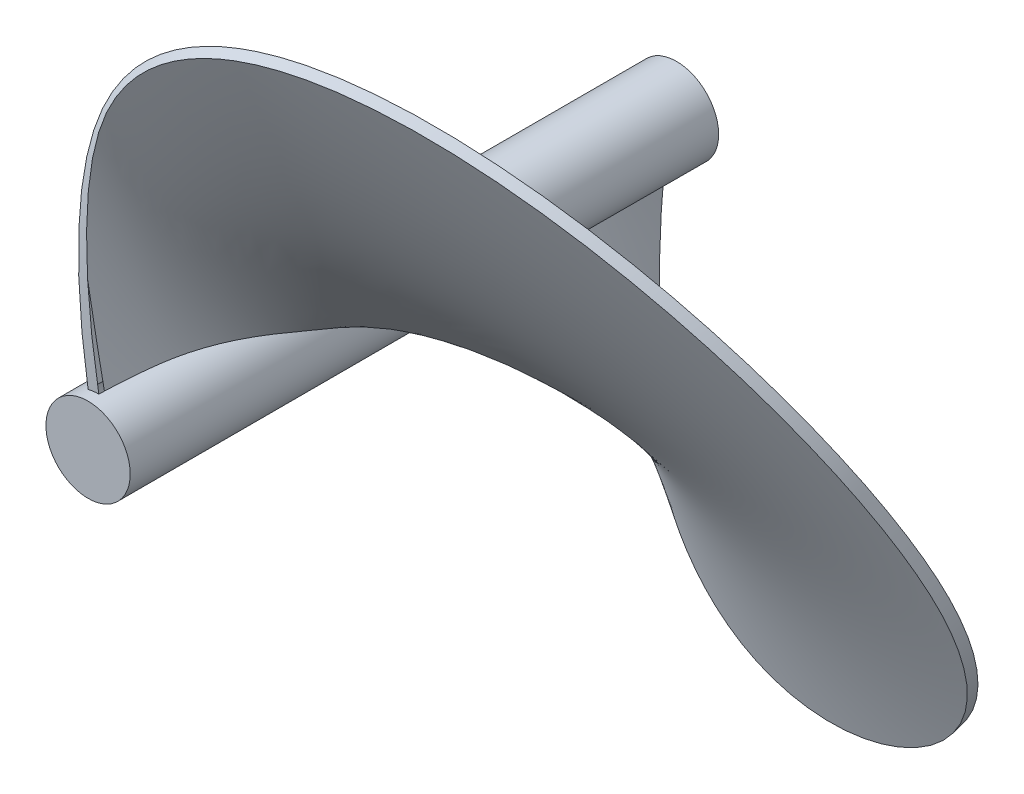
ISO-10303-21;
HEADER;
FILE_DESCRIPTION(('STEP AP214'),'2;1');
FILE_NAME('part.step','',(''),(''),'','','');
FILE_SCHEMA(('AUTOMOTIVE_DESIGN { 1 0 10303 214 1 1 1 1 }'));
ENDSEC;
DATA;
#1=APPLICATION_CONTEXT('core data for automotive mechanical design processes');
#2=APPLICATION_PROTOCOL_DEFINITION('international standard','automotive_design',2000,#1);
#3=PRODUCT_CONTEXT('',#1,'mechanical');
#4=PRODUCT('Part','Part','',(#3));
#5=PRODUCT_RELATED_PRODUCT_CATEGORY('part','',(#4));
#6=PRODUCT_DEFINITION_FORMATION('','',#4);
#7=PRODUCT_DEFINITION_CONTEXT('part definition',#1,'design');
#8=PRODUCT_DEFINITION('design','',#6,#7);
#9=PRODUCT_DEFINITION_SHAPE('','',#8);
#10=(LENGTH_UNIT() NAMED_UNIT(*) SI_UNIT(.MILLI.,.METRE.));
#11=(NAMED_UNIT(*) PLANE_ANGLE_UNIT() SI_UNIT($,.RADIAN.));
#12=(NAMED_UNIT(*) SI_UNIT($,.STERADIAN.) SOLID_ANGLE_UNIT());
#13=UNCERTAINTY_MEASURE_WITH_UNIT(LENGTH_MEASURE(1.E-05),#10,'distance_accuracy_value','');
#14=(GEOMETRIC_REPRESENTATION_CONTEXT(3) GLOBAL_UNCERTAINTY_ASSIGNED_CONTEXT((#13)) GLOBAL_UNIT_ASSIGNED_CONTEXT((#10,
#11,#12)) REPRESENTATION_CONTEXT('',''));
#15=CARTESIAN_POINT('',(0.,0.,0.));
#16=DIRECTION('',(0.,0.,1.));
#17=DIRECTION('',(1.,0.,0.));
#18=AXIS2_PLACEMENT_3D('',#15,#16,#17);
#19=CARTESIAN_POINT('',(0.,0.,2.35768688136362));
#20=DIRECTION('',(0.,0.,-1.));
#21=DIRECTION('',(-1.,0.,0.));
#22=AXIS2_PLACEMENT_3D('',#19,#20,#21);
#23=CYLINDRICAL_SURFACE('',#22,7.5);
#24=CARTESIAN_POINT('',(-0.111791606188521,-7.49916679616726,-100.332041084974));
#25=CARTESIAN_POINT('',(-0.106334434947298,-7.49924819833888,-100.175878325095));
#26=CARTESIAN_POINT('',(-0.100668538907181,-7.49932670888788,-100.019723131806));
#27=CARTESIAN_POINT('',(-0.0889024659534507,-7.49947533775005,-99.7074433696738));
#28=CARTESIAN_POINT('',(-0.0828023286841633,-7.49954545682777,-99.5513187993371));
#29=CARTESIAN_POINT('',(-0.0511712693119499,-7.49986858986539,-98.7707370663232));
#30=CARTESIAN_POINT('',(-0.0222495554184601,-7.50003921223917,-98.1464121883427));
#31=CARTESIAN_POINT('',(0.0438046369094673,-7.49994530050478,-96.8980191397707));
#32=CARTESIAN_POINT('',(0.0809393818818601,-7.49968064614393,-96.2739510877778));
#33=CARTESIAN_POINT('',(0.15068582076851,-7.49853760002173,-95.2338538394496));
#34=CARTESIAN_POINT('',(0.180695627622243,-7.49789254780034,-94.8176496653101));
#35=CARTESIAN_POINT('',(0.245396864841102,-7.49605440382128,-93.9855942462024));
#36=CARTESIAN_POINT('',(0.280088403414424,-7.49486129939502,-93.5697430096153));
#37=CARTESIAN_POINT('',(0.354810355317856,-7.49169612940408,-92.7384808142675));
#38=CARTESIAN_POINT('',(0.394841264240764,-7.48972399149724,-92.323069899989));
#39=CARTESIAN_POINT('',(0.481086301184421,-7.4846791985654,-91.4931355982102));
#40=CARTESIAN_POINT('',(0.527296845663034,-7.48160717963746,-91.0786118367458));
#41=CARTESIAN_POINT('',(0.627049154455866,-7.47390970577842,-90.2504776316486));
#42=CARTESIAN_POINT('',(0.68059040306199,-7.46928436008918,-89.8368671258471));
#43=CARTESIAN_POINT('',(0.767517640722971,-7.46068053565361,-89.2174354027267));
#44=CARTESIAN_POINT('',(0.797593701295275,-7.45753522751,-89.0111360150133));
#45=CARTESIAN_POINT('',(0.860175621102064,-7.45057668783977,-88.5989174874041));
#46=CARTESIAN_POINT('',(0.89268145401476,-7.44676346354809,-88.3929983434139));
#47=CARTESIAN_POINT('',(0.95193562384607,-7.4393865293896,-88.0330278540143));
#48=CARTESIAN_POINT('',(0.978092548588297,-7.43599863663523,-87.8788754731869));
#49=CARTESIAN_POINT('',(1.03199156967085,-7.4287099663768,-87.5708602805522));
#50=CARTESIAN_POINT('',(1.05973366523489,-7.4248091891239,-87.4169974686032));
#51=CARTESIAN_POINT('',(1.11665826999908,-7.41646158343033,-87.1095504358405));
#52=CARTESIAN_POINT('',(1.14584080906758,-7.41201474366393,-86.9559662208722));
#53=CARTESIAN_POINT('',(1.20555068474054,-7.40253749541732,-86.6490777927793));
#54=CARTESIAN_POINT('',(1.23607802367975,-7.39750708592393,-86.4957735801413));
#55=CARTESIAN_POINT('',(1.32954617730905,-7.38148375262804,-86.036232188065));
#56=CARTESIAN_POINT('',(1.39436545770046,-7.36955982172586,-85.7304074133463));
#57=CARTESIAN_POINT('',(1.52840030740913,-7.34293283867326,-85.119848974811));
#58=CARTESIAN_POINT('',(1.59761586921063,-7.32822979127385,-84.8151153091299));
#59=CARTESIAN_POINT('',(1.73990247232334,-7.29575637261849,-84.206838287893));
#60=CARTESIAN_POINT('',(1.81297200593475,-7.27798719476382,-83.9032945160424));
#61=CARTESIAN_POINT('',(1.9625223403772,-7.23909386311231,-83.2972684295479));
#62=CARTESIAN_POINT('',(2.03900313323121,-7.21796971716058,-82.9947861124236));
#63=CARTESIAN_POINT('',(2.27288625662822,-7.14915181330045,-82.0889381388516));
#64=CARTESIAN_POINT('',(2.43474125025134,-7.09600999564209,-81.4871211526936));
#65=CARTESIAN_POINT('',(2.76669446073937,-6.97328517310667,-80.2875019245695));
#66=CARTESIAN_POINT('',(2.93679220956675,-6.90370310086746,-79.6896994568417));
#67=CARTESIAN_POINT('',(3.2813890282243,-6.74672627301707,-78.4976655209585));
#68=CARTESIAN_POINT('',(3.45588839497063,-6.65933031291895,-77.9034342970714));
#69=CARTESIAN_POINT('',(3.8054253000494,-6.46596295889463,-76.7171121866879));
#70=CARTESIAN_POINT('',(3.98046325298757,-6.35996232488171,-76.1250261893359));
#71=CARTESIAN_POINT('',(4.32658241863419,-6.12975313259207,-74.9432125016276));
#72=CARTESIAN_POINT('',(4.49766345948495,-6.00554378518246,-74.3534849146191));
#73=CARTESIAN_POINT('',(4.83184462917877,-5.74010557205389,-73.1755225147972));
#74=CARTESIAN_POINT('',(4.99494382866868,-5.59887473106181,-72.5872878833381));
#75=CARTESIAN_POINT('',(5.30957457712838,-5.30144179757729,-71.4115175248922));
#76=CARTESIAN_POINT('',(5.46110626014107,-5.14523987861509,-70.8239817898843));
#77=CARTESIAN_POINT('',(5.74973824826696,-4.8205498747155,-69.6487870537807));
#78=CARTESIAN_POINT('',(5.88683912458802,-4.65206227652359,-69.0611280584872));
#79=CARTESIAN_POINT('',(6.14460057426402,-4.30586487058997,-67.8849207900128));
#80=CARTESIAN_POINT('',(6.26526108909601,-4.12815503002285,-67.2963725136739));
#81=CARTESIAN_POINT('',(6.48900256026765,-3.7667014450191,-66.1178116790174));
#82=CARTESIAN_POINT('',(6.592084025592,-3.58295787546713,-65.5277991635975));
#83=CARTESIAN_POINT('',(6.78035916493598,-3.2124643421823,-64.345871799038));
#84=CARTESIAN_POINT('',(6.86555282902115,-3.02571437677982,-63.7539569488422));
#85=CARTESIAN_POINT('',(7.018388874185,-2.65197553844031,-62.5683077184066));
#86=CARTESIAN_POINT('',(7.08604079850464,-2.46498685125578,-61.9745745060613));
#87=CARTESIAN_POINT('',(7.20474315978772,-2.09280799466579,-60.7848953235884));
#88=CARTESIAN_POINT('',(7.25579355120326,-1.90761783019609,-60.1889493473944));
#89=CARTESIAN_POINT('',(7.34250036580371,-1.54054323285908,-58.9948558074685));
#90=CARTESIAN_POINT('',(7.37815499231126,-1.35865918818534,-58.3967079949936));
#91=CARTESIAN_POINT('',(7.43538464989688,-0.999103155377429,-57.198485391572));
#92=CARTESIAN_POINT('',(7.45695968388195,-0.82143116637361,-56.5984106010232));
#93=CARTESIAN_POINT('',(7.48728430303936,-0.470687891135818,-55.3971146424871));
#94=CARTESIAN_POINT('',(7.49604393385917,-0.297613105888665,-54.7958947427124));
#95=CARTESIAN_POINT('',(7.50181927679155,0.044435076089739,-53.5922348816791));
#96=CARTESIAN_POINT('',(7.49883488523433,0.213408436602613,-52.9897949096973));
#97=CARTESIAN_POINT('',(7.48182135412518,0.548128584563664,-51.7842539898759));
#98=CARTESIAN_POINT('',(7.46779346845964,0.713875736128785,-51.1811531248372));
#99=CARTESIAN_POINT('',(7.4288873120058,1.04365142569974,-49.9748451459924));
#100=CARTESIAN_POINT('',(7.40400925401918,1.20767999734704,-49.3716380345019));
#101=CARTESIAN_POINT('',(7.34301711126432,1.5355322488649,-48.1661961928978));
#102=CARTESIAN_POINT('',(7.30691106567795,1.69935599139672,-47.5639610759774));
#103=CARTESIAN_POINT('',(7.22264093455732,2.02785726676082,-46.36053060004));
#104=CARTESIAN_POINT('',(7.1744762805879,2.19253483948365,-45.7593352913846));
#105=CARTESIAN_POINT('',(7.06495070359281,2.5232598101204,-44.5577135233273));
#106=CARTESIAN_POINT('',(7.00357359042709,2.68930864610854,-43.9572889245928));
#107=CARTESIAN_POINT('',(6.86646983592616,3.0222494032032,-42.7582943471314));
#108=CARTESIAN_POINT('',(6.79074295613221,3.18914133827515,-42.1597243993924));
#109=CARTESIAN_POINT('',(6.62380088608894,3.52278934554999,-40.9646866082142));
#110=CARTESIAN_POINT('',(6.53258536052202,3.68954541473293,-40.3682188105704));
#111=CARTESIAN_POINT('',(6.33375847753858,4.0213038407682,-39.1775286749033));
#112=CARTESIAN_POINT('',(6.22614724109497,4.1863062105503,-38.5833063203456));
#113=CARTESIAN_POINT('',(5.99395726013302,4.51248945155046,-37.3966725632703));
#114=CARTESIAN_POINT('',(5.86936697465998,4.67366763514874,-36.8042626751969));
#115=CARTESIAN_POINT('',(5.60338345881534,4.98945802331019,-35.6214625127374));
#116=CARTESIAN_POINT('',(5.4619902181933,5.14407022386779,-35.0310722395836));
#117=CARTESIAN_POINT('',(5.16326526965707,5.44384485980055,-33.8519415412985));
#118=CARTESIAN_POINT('',(5.00593399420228,5.58900755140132,-33.263201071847));
#119=CARTESIAN_POINT('',(4.67703157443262,5.86700300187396,-32.0867883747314));
#120=CARTESIAN_POINT('',(4.50546048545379,5.99983580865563,-31.4991161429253));
#121=CARTESIAN_POINT('',(4.15059138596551,6.25058320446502,-30.3240121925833));
#122=CARTESIAN_POINT('',(3.96729132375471,6.36849517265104,-29.7365805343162));
#123=CARTESIAN_POINT('',(3.59228128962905,6.58730900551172,-28.5612266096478));
#124=CARTESIAN_POINT('',(3.40057122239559,6.68821067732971,-27.9733043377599));
#125=CARTESIAN_POINT('',(3.01260583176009,6.87169935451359,-26.7961696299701));
#126=CARTESIAN_POINT('',(2.81635095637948,6.95428815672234,-26.2069573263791));
#127=CARTESIAN_POINT('',(2.42341282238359,7.10077767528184,-25.0263847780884));
#128=CARTESIAN_POINT('',(2.2267295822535,7.16467918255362,-24.435024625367));
#129=CARTESIAN_POINT('',(1.83736181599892,7.27426680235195,-23.2503904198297));
#130=CARTESIAN_POINT('',(1.64467128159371,7.31998250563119,-22.6571210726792));
#131=CARTESIAN_POINT('',(1.26679806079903,7.39474978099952,-21.4671839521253));
#132=CARTESIAN_POINT('',(1.08161487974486,7.42380245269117,-20.8705164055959));
#133=CARTESIAN_POINT('',(0.812005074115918,7.45646473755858,-19.9726808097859));
#134=CARTESIAN_POINT('',(0.723493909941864,7.46553279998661,-19.6729225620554));
#135=CARTESIAN_POINT('',(0.549568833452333,7.48034660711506,-19.0724308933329));
#136=CARTESIAN_POINT('',(0.464154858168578,7.48609241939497,-18.7716974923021));
#137=CARTESIAN_POINT('',(0.2967802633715,7.49459440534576,-18.1692172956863));
#138=CARTESIAN_POINT('',(0.214819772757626,7.49735046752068,-17.8674704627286));
#139=CARTESIAN_POINT('',(0.0546927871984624,7.50022810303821,-17.2629373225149));
#140=CARTESIAN_POINT('',(-0.0234734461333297,7.50034949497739,-16.9601509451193));
#141=CARTESIAN_POINT('',(-0.201278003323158,7.49798846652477,-16.2514612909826));
#142=CARTESIAN_POINT('',(-0.299288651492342,7.49461593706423,-15.8451511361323));
#143=CARTESIAN_POINT('',(-0.487060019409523,7.48475840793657,-15.0306519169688));
#144=CARTESIAN_POINT('',(-0.576820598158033,7.47827335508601,-14.6224628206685));
#145=CARTESIAN_POINT('',(-0.70447681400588,7.46696323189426,-14.0087838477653));
#146=CARTESIAN_POINT('',(-0.745863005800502,7.46292965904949,-13.804001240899));
#147=CARTESIAN_POINT('',(-0.826151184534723,7.45446861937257,-13.3939574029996));
#148=CARTESIAN_POINT('',(-0.865053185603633,7.45004115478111,-13.1886961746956));
#149=CARTESIAN_POINT('',(-0.940157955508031,7.44093640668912,-12.7776542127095));
#150=CARTESIAN_POINT('',(-0.97636032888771,7.43625908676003,-12.5718734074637));
#151=CARTESIAN_POINT('',(-1.04593829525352,7.42679269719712,-12.1598370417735));
#152=CARTESIAN_POINT('',(-1.0793138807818,7.42200362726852,-11.953581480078));
#153=CARTESIAN_POINT('',(-1.14355095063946,7.41237778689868,-11.5406653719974));
#154=CARTESIAN_POINT('',(-1.17441224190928,7.40754101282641,-11.3340047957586));
#155=CARTESIAN_POINT('',(-1.23383392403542,7.39787523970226,-10.9203537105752));
#156=CARTESIAN_POINT('',(-1.26239430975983,7.39304624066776,-10.7133632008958));
#157=CARTESIAN_POINT('',(-1.34494514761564,7.37863536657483,-10.0919683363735));
#158=CARTESIAN_POINT('',(-1.39580471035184,7.36912970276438,-9.67714436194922));
#159=CARTESIAN_POINT('',(-1.48822716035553,7.35100504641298,-8.86702684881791));
#160=CARTESIAN_POINT('',(-1.53012324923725,7.34236542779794,-8.47177122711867));
#161=CARTESIAN_POINT('',(-1.60851853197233,7.3255903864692,-7.68074213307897));
#162=CARTESIAN_POINT('',(-1.64501806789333,7.31745493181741,-7.28496869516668));
#163=CARTESIAN_POINT('',(-1.71334108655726,7.30175926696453,-6.49302175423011));
#164=CARTESIAN_POINT('',(-1.74516470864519,7.29419903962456,-6.09684826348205));
#165=CARTESIAN_POINT('',(-1.8046916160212,7.27969954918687,-5.30417995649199));
#166=CARTESIAN_POINT('',(-1.83239487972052,7.2727602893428,-4.90768513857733));
#167=CARTESIAN_POINT('',(-1.88414891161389,7.25952453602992,-4.11378309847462));
#168=CARTESIAN_POINT('',(-1.90819350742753,7.25322913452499,-3.71637545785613));
#169=CARTESIAN_POINT('',(-1.95290381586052,7.24131906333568,-2.92137428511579));
#170=CARTESIAN_POINT('',(-1.9735696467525,7.2357043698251,-2.52378075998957));
#171=CARTESIAN_POINT('',(-2.00223999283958,7.22780273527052,-1.92722209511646));
#172=CARTESIAN_POINT('',(-2.01140973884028,7.22525529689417,-1.72831552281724));
#173=CARTESIAN_POINT('',(-2.02900332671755,7.22033441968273,-1.3304657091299));
#174=CARTESIAN_POINT('',(-2.03742716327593,7.21796098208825,-1.13152246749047));
#175=CARTESIAN_POINT('',(-2.05356117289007,7.21338734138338,-0.733593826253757));
#176=CARTESIAN_POINT('',(-2.06127130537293,7.21118714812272,-0.53460842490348));
#177=CARTESIAN_POINT('',(-2.07601087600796,7.20695753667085,-0.136612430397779));
#178=CARTESIAN_POINT('',(-2.0830403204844,7.20492811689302,0.0623981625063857));
#179=CARTESIAN_POINT('',(-2.08974624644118,7.20298275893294,0.261420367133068));
#180=B_SPLINE_CURVE_WITH_KNOTS('',3,(#24,#25,#26,#27,#28,#29,#30,#31,#32,#33,#34,#35,#36,#37,
#38,#39,#40,#41,#42,#43,#44,#45,#46,#47,#48,#49,#50,#51,#52,#53,#54,#55,#56,#57,#58,#59,#60,#61,
#62,#63,#64,#65,#66,#67,#68,#69,#70,#71,#72,#73,#74,#75,#76,#77,#78,#79,#80,#81,#82,#83,#84,#85,
#86,#87,#88,#89,#90,#91,#92,#93,#94,#95,#96,#97,#98,#99,#100,#101,#102,#103,#104,#105,#106,#107,
#108,#109,#110,#111,#112,#113,#114,#115,#116,#117,#118,#119,#120,#121,#122,#123,#124,#125,#126,
#127,#128,#129,#130,#131,#132,#133,#134,#135,#136,#137,#138,#139,#140,#141,#142,#143,#144,#145,
#146,#147,#148,#149,#150,#151,#152,#153,#154,#155,#156,#157,#158,#159,#160,#161,#162,#163,#164,
#165,#166,#167,#168,#169,#170,#171,#172,#173,#174,#175,#176,#177,#178,#179),.UNSPECIFIED.,.F.,
.F.,(4,2,2,2,2,2,2,2,2,2,2,2,2,2,2,2,2,2,2,2,2,2,2,2,2,2,2,2,2,2,2,2,2,2,2,2,2,2,2,2,2,2,2,2,2,
2,2,2,2,2,2,2,2,2,2,2,2,2,2,2,2,2,2,2,2,2,2,2,2,2,2,2,2,2,2,2,2,4),(0.,0.46877359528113,
0.937504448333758,2.81243679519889,4.68788721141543,5.9397202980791,7.19158232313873,
8.44356062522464,9.69481603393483,10.9459834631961,11.5714830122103,12.1969757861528,
12.666144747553,13.1353134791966,13.6044919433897,14.0736712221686,15.0121554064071,
15.9506379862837,16.8887561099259,17.8268720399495,19.7029486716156,21.5789189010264,
23.4550160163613,25.334088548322,27.213242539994,29.0926148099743,30.9719652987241,
32.8512413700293,34.7305241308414,36.6097524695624,38.4889818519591,40.3671867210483,
42.2453967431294,44.123825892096,46.0022546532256,47.8792101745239,49.7561822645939,
51.6329412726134,53.5096634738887,55.3850450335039,57.2605150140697,59.138296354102,
61.0161089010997,62.8939621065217,64.7718014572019,66.6509236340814,68.5300469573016,
70.4091193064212,72.2881843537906,74.1675790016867,76.0469949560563,77.9262264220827,
79.8053783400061,81.6814599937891,83.5574178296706,84.4954424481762,85.4334479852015,
86.3714885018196,87.309593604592,88.5634342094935,89.8172962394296,90.4441686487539,
91.0710374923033,91.6979979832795,92.3249601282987,92.9519703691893,93.5789820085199,
94.8330165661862,96.0256678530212,97.2182435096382,98.4107836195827,99.6033299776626,
100.797866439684,101.992361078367,102.589762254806,103.187167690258,103.784607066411,
104.38204089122),.UNSPECIFIED.);
#181=CARTESIAN_POINT('',(-0.111764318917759,-7.49917085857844,-100.332025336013));
#182=VERTEX_POINT('',#181);
#183=CARTESIAN_POINT('',(-2.08977326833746,7.20297867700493,0.26143603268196));
#184=VERTEX_POINT('',#183);
#185=EDGE_CURVE('E59',#182,#184,#180,.T.);
#186=ORIENTED_EDGE('',*,*,#185,.F.);
#187=CARTESIAN_POINT('',(-2.08902687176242,-7.20319142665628,-100.261425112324));
#188=CARTESIAN_POINT('',(-2.04764550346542,-7.21519264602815,-100.263081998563));
#189=CARTESIAN_POINT('',(-2.0061605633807,-7.22683723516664,-100.264735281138));
#190=CARTESIAN_POINT('',(-1.92299582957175,-7.24940986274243,-100.268032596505));
#191=CARTESIAN_POINT('',(-1.88131603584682,-7.26033790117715,-100.269676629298));
#192=CARTESIAN_POINT('',(-1.79777388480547,-7.28147413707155,-100.272953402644));
#193=CARTESIAN_POINT('',(-1.75591152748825,-7.29168233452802,-100.274586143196));
#194=CARTESIAN_POINT('',(-1.67201660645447,-7.31137586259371,-100.2778382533));
#195=CARTESIAN_POINT('',(-1.62998404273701,-7.32086119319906,-100.279457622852));
#196=CARTESIAN_POINT('',(-1.5457611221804,-7.3391061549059,-100.282680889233));
#197=CARTESIAN_POINT('',(-1.50357076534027,-7.34786578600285,-100.284284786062));
#198=CARTESIAN_POINT('',(-1.41904468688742,-7.36465673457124,-100.287474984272));
#199=CARTESIAN_POINT('',(-1.37670896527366,-7.37268805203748,-100.289061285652));
#200=CARTESIAN_POINT('',(-1.29190475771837,-7.38801995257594,-100.292214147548));
#201=CARTESIAN_POINT('',(-1.24943627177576,-7.39532053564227,-100.293780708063));
#202=CARTESIAN_POINT('',(-1.16437870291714,-7.40918882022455,-100.296891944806));
#203=CARTESIAN_POINT('',(-1.12178962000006,-7.41575652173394,-100.298436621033));
#204=CARTESIAN_POINT('',(-1.05782662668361,-7.42505670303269,-100.300735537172));
#205=CARTESIAN_POINT('',(-1.03649269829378,-7.42806483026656,-100.301498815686));
#206=CARTESIAN_POINT('',(-0.972451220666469,-7.43681352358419,-100.303779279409));
#207=CARTESIAN_POINT('',(-0.929705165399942,-7.44227821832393,-100.305287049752));
#208=CARTESIAN_POINT('',(-0.844125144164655,-7.45247005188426,-100.308275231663));
#209=CARTESIAN_POINT('',(-0.801291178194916,-7.45719719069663,-100.309755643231));
#210=CARTESIAN_POINT('',(-0.672662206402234,-7.47027140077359,-100.314153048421));
#211=CARTESIAN_POINT('',(-0.586749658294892,-7.4775099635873,-100.317025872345));
#212=CARTESIAN_POINT('',(-0.436011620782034,-7.48759658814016,-100.321941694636));
#213=CARTESIAN_POINT('',(-0.371228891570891,-7.49108785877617,-100.324014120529));
#214=CARTESIAN_POINT('',(-0.241548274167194,-7.49639038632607,-100.328076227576));
#215=CARTESIAN_POINT('',(-0.176650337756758,-7.49820050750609,-100.330065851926));
#216=CARTESIAN_POINT('',(-0.111736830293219,-7.4991676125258,-100.3320097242));
#217=B_SPLINE_CURVE_WITH_KNOTS('',3,(#187,#188,#189,#190,#191,#192,#193,#194,#195,#196,#197,
#198,#199,#200,#201,#202,#203,#204,#205,#206,#207,#208,#209,#210,#211,#212,#213,#214,#215,#216),
.UNSPECIFIED.,.F.,.F.,(4,2,2,2,2,2,2,2,2,2,2,2,2,2,4),(0.,0.12935345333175,0.258706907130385,
0.388060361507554,0.517413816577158,0.64676727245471,0.776120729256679,0.905474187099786,
1.03482764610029,1.0995025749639,1.22885603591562,1.35820949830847,1.61694528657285,
1.81165450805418,2.00649517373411),.UNSPECIFIED.);
#218=CARTESIAN_POINT('',(-2.08898783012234,-7.20320467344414,-100.261402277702));
#219=VERTEX_POINT('',#218);
#220=EDGE_CURVE('E53',#219,#182,#217,.T.);
#221=ORIENTED_EDGE('',*,*,#220,.F.);
#222=CARTESIAN_POINT('',(-2.08897450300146,-7.2032066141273,-100.261394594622));
#223=CARTESIAN_POINT('',(-2.07850869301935,-7.20624096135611,-99.9490830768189));
#224=CARTESIAN_POINT('',(-2.06723944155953,-7.20948530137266,-99.6368007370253));
#225=CARTESIAN_POINT('',(-2.04297000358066,-7.21640040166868,-99.0122977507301));
#226=CARTESIAN_POINT('',(-2.02996975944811,-7.22007117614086,-98.7000771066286));
#227=CARTESIAN_POINT('',(-1.98818533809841,-7.2317331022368,-97.7634939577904));
#228=CARTESIAN_POINT('',(-1.95661910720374,-7.24037337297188,-97.139260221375));
#229=CARTESIAN_POINT('',(-1.88505749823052,-7.25933423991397,-95.8913019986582));
#230=CARTESIAN_POINT('',(-1.84506218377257,-7.26965482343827,-95.267577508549));
#231=CARTESIAN_POINT('',(-1.75523167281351,-7.29186584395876,-94.0208076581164));
#232=CARTESIAN_POINT('',(-1.70539567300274,-7.3037564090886,-93.3977623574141));
#233=CARTESIAN_POINT('',(-1.59375144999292,-7.3289339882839,-92.152713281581));
#234=CARTESIAN_POINT('',(-1.53194258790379,-7.34222107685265,-91.530709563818));
#235=CARTESIAN_POINT('',(-1.42779955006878,-7.36292179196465,-90.598865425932));
#236=CARTESIAN_POINT('',(-1.39117102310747,-7.36995199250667,-90.2883767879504));
#237=CARTESIAN_POINT('',(-1.31355217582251,-7.38418208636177,-89.6679447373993));
#238=CARTESIAN_POINT('',(-1.272561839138,-7.39138198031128,-89.3580013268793));
#239=CARTESIAN_POINT('',(-1.18558180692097,-7.40583160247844,-88.7388527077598));
#240=CARTESIAN_POINT('',(-1.13959275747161,-7.41308132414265,-88.4296474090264));
#241=CARTESIAN_POINT('',(-1.06628930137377,-7.4238557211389,-87.9665249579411));
#242=CARTESIAN_POINT('',(-1.04113494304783,-7.42743047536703,-87.8122656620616));
#243=CARTESIAN_POINT('',(-0.989253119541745,-7.43451839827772,-87.5040100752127));
#244=CARTESIAN_POINT('',(-0.962525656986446,-7.43803156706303,-87.3500137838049));
#245=CARTESIAN_POINT('',(-0.907512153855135,-7.44494389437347,-87.0422652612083));
#246=CARTESIAN_POINT('',(-0.879225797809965,-7.44834302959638,-86.8885130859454));
#247=CARTESIAN_POINT('',(-0.821205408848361,-7.45496310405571,-86.5812784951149));
#248=CARTESIAN_POINT('',(-0.791471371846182,-7.45818404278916,-86.42779608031));
#249=CARTESIAN_POINT('',(-0.70020654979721,-7.46749282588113,-85.9677450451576));
#250=CARTESIAN_POINT('',(-0.636613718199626,-7.47322655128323,-85.6615763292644));
#251=CARTESIAN_POINT('',(-0.50443349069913,-7.48331085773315,-85.0502576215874));
#252=CARTESIAN_POINT('',(-0.435845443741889,-7.48766125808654,-84.7451077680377));
#253=CARTESIAN_POINT('',(-0.294093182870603,-7.49456786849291,-84.1358585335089));
#254=CARTESIAN_POINT('',(-0.220929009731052,-7.49712409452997,-83.8317591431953));
#255=CARTESIAN_POINT('',(0.00483846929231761,-7.50150727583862,-82.9211902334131));
#256=CARTESIAN_POINT('',(0.163758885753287,-7.50005241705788,-82.3162572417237));
#257=CARTESIAN_POINT('',(0.495714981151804,-7.48544371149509,-81.1104374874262));
#258=CARTESIAN_POINT('',(0.668750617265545,-7.47228990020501,-80.5095507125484));
#259=CARTESIAN_POINT('',(1.02631338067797,-7.43162764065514,-79.3106614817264));
#260=CARTESIAN_POINT('',(1.21085815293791,-7.40409664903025,-78.7126650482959));
#261=CARTESIAN_POINT('',(1.58783439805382,-7.33250133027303,-77.5201296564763));
#262=CARTESIAN_POINT('',(1.78026621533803,-7.28843628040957,-76.9255908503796));
#263=CARTESIAN_POINT('',(2.16922507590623,-7.18227616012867,-75.7393831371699));
#264=CARTESIAN_POINT('',(2.36575264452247,-7.12017876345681,-75.1477146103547));
#265=CARTESIAN_POINT('',(2.75877383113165,-6.97731138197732,-73.9666322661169));
#266=CARTESIAN_POINT('',(2.95526744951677,-6.89654162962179,-73.3772184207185));
#267=CARTESIAN_POINT('',(3.3440868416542,-6.71661874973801,-72.1998122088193));
#268=CARTESIAN_POINT('',(3.53641255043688,-6.61746533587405,-71.6118198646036));
#269=CARTESIAN_POINT('',(3.91301022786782,-6.40198550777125,-70.4364001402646));
#270=CARTESIAN_POINT('',(4.09728216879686,-6.28565903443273,-69.8489727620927));
#271=CARTESIAN_POINT('',(4.45441203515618,-6.03783585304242,-68.6738647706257));
#272=CARTESIAN_POINT('',(4.62727023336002,-5.90633950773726,-68.0861841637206));
#273=CARTESIAN_POINT('',(4.95895326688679,-5.6307450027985,-66.9098217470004));
#274=CARTESIAN_POINT('',(5.11777813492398,-5.48664687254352,-66.3211399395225));
#275=CARTESIAN_POINT('',(5.41957873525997,-5.1887505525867,-65.1423120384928));
#276=CARTESIAN_POINT('',(5.56255776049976,-5.03495438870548,-64.552166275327));
#277=CARTESIAN_POINT('',(5.83176721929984,-4.72052398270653,-63.3698789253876));
#278=CARTESIAN_POINT('',(5.95799749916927,-4.55988967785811,-62.7777373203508));
#279=CARTESIAN_POINT('',(6.19353258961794,-4.23444466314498,-61.5912460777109));
#280=CARTESIAN_POINT('',(6.30283737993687,-4.06963394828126,-60.9968964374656));
#281=CARTESIAN_POINT('',(6.50496095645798,-3.73807389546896,-59.8059640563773));
#282=CARTESIAN_POINT('',(6.59778015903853,-3.57132460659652,-59.2093813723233));
#283=CARTESIAN_POINT('',(6.76767446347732,-3.23783266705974,-58.0150677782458));
#284=CARTESIAN_POINT('',(6.84477530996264,-3.07109046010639,-57.4173403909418));
#285=CARTESIAN_POINT('',(6.98453611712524,-2.73839707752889,-56.2200701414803));
#286=CARTESIAN_POINT('',(7.04719785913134,-2.57244580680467,-55.6205275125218));
#287=CARTESIAN_POINT('',(7.15927340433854,-2.2417181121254,-54.4199435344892));
#288=CARTESIAN_POINT('',(7.20868828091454,-2.07694159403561,-53.8189023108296));
#289=CARTESIAN_POINT('',(7.29536963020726,-1.74827789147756,-52.6156542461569));
#290=CARTESIAN_POINT('',(7.33263507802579,-1.58439078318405,-52.0134473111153));
#291=CARTESIAN_POINT('',(7.39587377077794,-1.25656453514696,-50.8081194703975));
#292=CARTESIAN_POINT('',(7.4218410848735,-1.09262541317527,-50.204998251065));
#293=CARTESIAN_POINT('',(7.46291299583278,-0.763202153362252,-48.9987932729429));
#294=CARTESIAN_POINT('',(7.47801735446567,-0.597717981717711,-48.3957095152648));
#295=CARTESIAN_POINT('',(7.49723059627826,-0.263646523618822,-47.1901736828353));
#296=CARTESIAN_POINT('',(7.50133866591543,-0.0950590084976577,-46.5877216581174));
#297=CARTESIAN_POINT('',(7.49790034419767,0.246152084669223,-45.3839938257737));
#298=CARTESIAN_POINT('',(7.49035406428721,0.418775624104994,-44.7827180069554));
#299=CARTESIAN_POINT('',(7.46257744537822,0.768590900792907,-43.5813330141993));
#300=CARTESIAN_POINT('',(7.44233839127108,0.945785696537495,-42.9812249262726));
#301=CARTESIAN_POINT('',(7.38791741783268,1.30443932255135,-41.7829086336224));
#302=CARTESIAN_POINT('',(7.35373549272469,1.48589815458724,-41.1847004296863));
#303=CARTESIAN_POINT('',(7.27010909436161,1.85224047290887,-39.9904638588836));
#304=CARTESIAN_POINT('',(7.2206662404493,2.03712359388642,-39.3944352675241));
#305=CARTESIAN_POINT('',(7.10529457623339,2.40886861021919,-38.2045884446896));
#306=CARTESIAN_POINT('',(7.03936581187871,2.59573050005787,-37.6107702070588));
#307=CARTESIAN_POINT('',(6.89004208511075,2.96948249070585,-36.4248770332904));
#308=CARTESIAN_POINT('',(6.8066350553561,3.15637252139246,-35.8328035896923));
#309=CARTESIAN_POINT('',(6.62194473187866,3.52743215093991,-34.6505906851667));
#310=CARTESIAN_POINT('',(6.52066144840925,3.71160175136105,-34.0604512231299));
#311=CARTESIAN_POINT('',(6.30045271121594,4.07422072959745,-32.8816888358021));
#312=CARTESIAN_POINT('',(6.18152682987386,4.25266996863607,-32.2930659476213));
#313=CARTESIAN_POINT('',(5.92708436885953,4.60066470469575,-31.1167755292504));
#314=CARTESIAN_POINT('',(5.79156784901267,4.77021023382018,-30.5291079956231));
#315=CARTESIAN_POINT('',(5.50585162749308,5.09732812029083,-29.3539157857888));
#316=CARTESIAN_POINT('',(5.35564986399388,5.25489879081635,-28.7663911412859));
#317=CARTESIAN_POINT('',(5.04335802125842,5.55531096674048,-27.5907289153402));
#318=CARTESIAN_POINT('',(4.88126780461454,5.69815230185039,-27.0025913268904));
#319=CARTESIAN_POINT('',(4.5487219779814,5.96697918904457,-25.8249064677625));
#320=CARTESIAN_POINT('',(4.37826730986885,6.09296663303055,-25.235359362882));
#321=CARTESIAN_POINT('',(4.03298390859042,6.32681005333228,-24.0539839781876));
#322=CARTESIAN_POINT('',(3.85815536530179,6.43466681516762,-23.4621557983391));
#323=CARTESIAN_POINT('',(3.50861849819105,6.63172683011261,-22.2764261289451));
#324=CARTESIAN_POINT('',(3.33391043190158,6.72095974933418,-21.6825294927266));
#325=CARTESIAN_POINT('',(2.98849163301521,6.88151179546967,-20.4912111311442));
#326=CARTESIAN_POINT('',(2.81778059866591,6.95283227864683,-19.8937896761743));
#327=CARTESIAN_POINT('',(2.48423664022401,7.07886801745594,-18.694991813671));
#328=CARTESIAN_POINT('',(2.32140394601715,7.1335827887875,-18.0936152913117));
#329=CARTESIAN_POINT('',(2.00721960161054,7.22827705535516,-16.8866527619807));
#330=CARTESIAN_POINT('',(1.85586874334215,7.26825553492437,-16.2810664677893));
#331=CARTESIAN_POINT('',(1.6401650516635,7.31883372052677,-15.3694268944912));
#332=CARTESIAN_POINT('',(1.57014211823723,7.33412964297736,-15.0649618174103));
#333=CARTESIAN_POINT('',(1.43438151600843,7.36188470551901,-14.4549430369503));
#334=CARTESIAN_POINT('',(1.36864387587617,7.37434382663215,-14.1493893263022));
#335=CARTESIAN_POINT('',(1.24204823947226,7.39671864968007,-13.5372252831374));
#336=CARTESIAN_POINT('',(1.18118948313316,7.40663474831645,-13.2306151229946));
#337=CARTESIAN_POINT('',(1.09409235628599,7.41982648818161,-12.7698656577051));
#338=CARTESIAN_POINT('',(1.06575866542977,7.42394331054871,-12.616144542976));
#339=CARTESIAN_POINT('',(1.01062064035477,7.43164987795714,-12.3084146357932));
#340=CARTESIAN_POINT('',(0.983816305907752,7.43523962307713,-12.1544058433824));
#341=CARTESIAN_POINT('',(0.914972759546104,7.44410492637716,-11.7465303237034));
#342=CARTESIAN_POINT('',(0.874277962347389,7.44897142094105,-11.4924270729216));
#343=CARTESIAN_POINT('',(0.796608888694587,7.4576759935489,-10.9836341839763));
#344=CARTESIAN_POINT('',(0.759634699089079,7.46151404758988,-10.7289445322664));
#345=CARTESIAN_POINT('',(0.653661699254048,7.47180100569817,-9.96412588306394));
#346=CARTESIAN_POINT('',(0.589619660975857,7.47702183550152,-9.45329082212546));
#347=CARTESIAN_POINT('',(0.472056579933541,7.4853591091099,-8.43021532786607));
#348=CARTESIAN_POINT('',(0.418539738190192,7.48847471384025,-7.91797441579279));
#349=CARTESIAN_POINT('',(0.320164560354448,7.49332477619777,-6.89268956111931));
#350=CARTESIAN_POINT('',(0.275305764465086,7.49505930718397,-6.37964566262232));
#351=CARTESIAN_POINT('',(0.192695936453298,7.49763806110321,-5.35064264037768));
#352=CARTESIAN_POINT('',(0.154978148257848,7.49847820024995,-4.83468086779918));
#353=CARTESIAN_POINT('',(0.085948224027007,7.49958682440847,-3.80243561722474));
#354=CARTESIAN_POINT('',(0.0546347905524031,7.49985542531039,-3.28615222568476));
#355=CARTESIAN_POINT('',(0.0119418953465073,7.50000378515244,-2.51134915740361));
#356=CARTESIAN_POINT('',(-0.00157942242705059,7.50001078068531,-2.25294510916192));
#357=CARTESIAN_POINT('',(-0.0272628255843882,7.4999614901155,-1.73605744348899));
#358=CARTESIAN_POINT('',(-0.0394248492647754,7.4999052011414,-1.47757382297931));
#359=CARTESIAN_POINT('',(-0.0624601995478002,7.49974877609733,-0.960522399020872));
#360=CARTESIAN_POINT('',(-0.073333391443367,7.49964863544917,-0.701954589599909));
#361=CARTESIAN_POINT('',(-0.093862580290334,7.49941951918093,-0.184783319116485));
#362=CARTESIAN_POINT('',(-0.103518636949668,7.49929054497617,0.0738201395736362));
#363=CARTESIAN_POINT('',(-0.112603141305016,7.49915465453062,0.332443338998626));
#364=B_SPLINE_CURVE_WITH_KNOTS('',3,(#222,#223,#224,#225,#226,#227,#228,#229,#230,#231,#232,
#233,#234,#235,#236,#237,#238,#239,#240,#241,#242,#243,#244,#245,#246,#247,#248,#249,#250,#251,
#252,#253,#254,#255,#256,#257,#258,#259,#260,#261,#262,#263,#264,#265,#266,#267,#268,#269,#270,
#271,#272,#273,#274,#275,#276,#277,#278,#279,#280,#281,#282,#283,#284,#285,#286,#287,#288,#289,
#290,#291,#292,#293,#294,#295,#296,#297,#298,#299,#300,#301,#302,#303,#304,#305,#306,#307,#308,
#309,#310,#311,#312,#313,#314,#315,#316,#317,#318,#319,#320,#321,#322,#323,#324,#325,#326,#327,
#328,#329,#330,#331,#332,#333,#334,#335,#336,#337,#338,#339,#340,#341,#342,#343,#344,#345,#346,
#347,#348,#349,#350,#351,#352,#353,#354,#355,#356,#357,#358,#359,#360,#361,#362,#363),
.UNSPECIFIED.,.F.,.F.,(4,2,2,2,2,2,2,2,2,2,2,2,2,2,2,2,2,2,2,2,2,2,2,2,2,2,2,2,2,2,2,2,2,2,2,2,
2,2,2,2,2,2,2,2,2,2,2,2,2,2,2,2,2,2,2,2,2,2,2,2,2,2,2,2,2,2,2,2,2,2,4),(0.,0.937502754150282,
1.8750367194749,3.75025468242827,5.62545849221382,7.50081544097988,9.37627248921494,
10.3144097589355,11.2525505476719,12.1905702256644,12.6595763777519,13.1285817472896,
13.5976823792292,14.0667843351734,15.0049995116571,15.9433371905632,16.8816665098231,
18.7577334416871,20.6337946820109,22.5128064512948,24.3919003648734,26.2712367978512,
28.1505498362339,30.0298921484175,31.9092409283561,33.7885447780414,35.6678442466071,
37.5467524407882,39.4256778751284,41.3046055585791,43.1834857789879,45.0592634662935,
46.9348096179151,48.8102037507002,50.6857560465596,52.5622917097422,54.438868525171,
56.3155841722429,58.1922818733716,60.0702695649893,61.9482580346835,63.8260472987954,
65.7038313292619,67.5829161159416,69.4619998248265,71.341129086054,73.2202515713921,
75.0996382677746,76.9790466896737,78.8582439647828,80.7373598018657,82.6134591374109,
84.4894163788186,86.3654283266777,88.2415695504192,89.1798968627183,90.118230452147,
91.0564175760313,91.5255045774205,91.9945915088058,92.7667150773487,93.5388566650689,
95.0832724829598,96.6283034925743,98.1732524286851,99.7252257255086,101.276884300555,
102.053154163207,102.829459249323,103.605845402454,104.382193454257),.UNSPECIFIED.);
#365=CARTESIAN_POINT('',(-0.112589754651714,7.49915670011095,0.33243557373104));
#366=VERTEX_POINT('',#365);
#367=EDGE_CURVE('E11',#219,#366,#364,.T.);
#368=ORIENTED_EDGE('',*,*,#367,.T.);
#369=CARTESIAN_POINT('',(-2.08979873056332,7.20296753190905,0.261450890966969));
#370=CARTESIAN_POINT('',(-2.0272752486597,7.22110766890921,0.263966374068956));
#371=CARTESIAN_POINT('',(-1.9645155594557,7.23843336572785,0.266473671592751));
#372=CARTESIAN_POINT('',(-1.83856550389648,7.2714451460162,0.271464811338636));
#373=CARTESIAN_POINT('',(-1.77537513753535,7.28713122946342,0.273948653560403));
#374=CARTESIAN_POINT('',(-1.64860546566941,7.31685304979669,0.278885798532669));
#375=CARTESIAN_POINT('',(-1.5850261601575,7.33088878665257,0.28133910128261));
#376=CARTESIAN_POINT('',(-1.48940257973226,7.35069653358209,0.284990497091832));
#377=CARTESIAN_POINT('',(-1.45748663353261,7.35709128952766,0.286202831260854));
#378=CARTESIAN_POINT('',(-1.39357360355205,7.36946484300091,0.288617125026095));
#379=CARTESIAN_POINT('',(-1.36157651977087,7.37544364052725,0.28981908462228));
#380=CARTESIAN_POINT('',(-1.29750686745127,7.38698419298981,0.292211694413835));
#381=CARTESIAN_POINT('',(-1.2654342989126,7.39254594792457,0.293402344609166));
#382=CARTESIAN_POINT('',(-1.20121901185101,7.40325147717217,0.295771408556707));
#383=CARTESIAN_POINT('',(-1.16907629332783,7.40839525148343,0.29694982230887));
#384=CARTESIAN_POINT('',(-1.10472614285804,7.41826392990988,0.299293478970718));
#385=CARTESIAN_POINT('',(-1.07251871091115,7.42298883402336,0.300458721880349));
#386=CARTESIAN_POINT('',(-1.0080445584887,7.43201895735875,0.302775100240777));
#387=CARTESIAN_POINT('',(-0.975777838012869,7.43632417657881,0.303926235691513));
#388=CARTESIAN_POINT('',(-0.911190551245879,7.44451418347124,0.3062134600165));
#389=CARTESIAN_POINT('',(-0.878869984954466,7.44839897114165,0.30734954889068));
#390=CARTESIAN_POINT('',(-0.814180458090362,7.45574743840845,0.309605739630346));
#391=CARTESIAN_POINT('',(-0.781811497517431,7.45921111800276,0.310725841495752));
#392=CARTESIAN_POINT('',(-0.717030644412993,7.46571676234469,0.312949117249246));
#393=CARTESIAN_POINT('',(-0.684618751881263,7.4687587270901,0.314052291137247));
#394=CARTESIAN_POINT('',(-0.619757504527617,7.47442040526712,0.316240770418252));
#395=CARTESIAN_POINT('',(-0.587308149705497,7.47704011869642,0.317326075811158));
#396=CARTESIAN_POINT('',(-0.522377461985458,7.48185682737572,0.319477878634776));
#397=CARTESIAN_POINT('',(-0.489896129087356,7.48405382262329,0.32054437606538));
#398=CARTESIAN_POINT('',(-0.424906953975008,7.48802470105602,0.322657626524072));
#399=CARTESIAN_POINT('',(-0.392399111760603,7.48979858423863,0.323704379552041));
#400=CARTESIAN_POINT('',(-0.327362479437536,7.49292290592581,0.325777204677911));
#401=CARTESIAN_POINT('',(-0.294833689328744,7.49427334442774,0.326803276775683));
#402=CARTESIAN_POINT('',(-0.212396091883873,7.49715820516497,0.329375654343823));
#403=CARTESIAN_POINT('',(-0.162476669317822,7.49840618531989,0.330907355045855));
#404=CARTESIAN_POINT('',(-0.112548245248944,7.49915547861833,0.332411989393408));
#405=B_SPLINE_CURVE_WITH_KNOTS('',3,(#369,#370,#371,#372,#373,#374,#375,#376,#377,#378,#379,
#380,#381,#382,#383,#384,#385,#386,#387,#388,#389,#390,#391,#392,#393,#394,#395,#396,#397,#398,
#399,#400,#401,#402,#403,#404),.UNSPECIFIED.,.F.,.F.,(4,2,2,2,2,2,2,2,2,2,2,2,2,2,2,2,2,4),(0.,
0.195444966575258,0.390889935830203,0.586334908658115,0.68405118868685,0.781767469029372,
0.879483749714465,0.977200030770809,1.07491631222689,1.1726325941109,1.27034887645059,
1.36806515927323,1.46578144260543,1.5634977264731,1.66121401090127,1.75893029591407,
1.85664658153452,2.00651258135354),.UNSPECIFIED.);
#406=EDGE_CURVE('E73',#184,#366,#405,.T.);
#407=ORIENTED_EDGE('',*,*,#406,.F.);
#408=EDGE_LOOP('',(#186,#221,#368,#407));
#409=FACE_BOUND('',#408,.T.);
#410=CARTESIAN_POINT('',(0.,0.,2.35768688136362));
#411=DIRECTION('',(0.,0.,1.));
#412=DIRECTION('',(1.,0.,0.));
#413=AXIS2_PLACEMENT_3D('',#410,#411,#412);
#414=CIRCLE('',#413,7.5);
#415=CARTESIAN_POINT('',(7.5,0.,2.35768688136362));
#416=VERTEX_POINT('',#415);
#417=EDGE_CURVE('E75',#416,#416,#414,.T.);
#418=ORIENTED_EDGE('',*,*,#417,.F.);
#419=EDGE_LOOP('',(#418));
#420=FACE_BOUND('',#419,.T.);
#421=CARTESIAN_POINT('',(0.,0.,-102.358018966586));
#422=DIRECTION('',(0.,0.,1.));
#423=DIRECTION('',(1.,0.,0.));
#424=AXIS2_PLACEMENT_3D('',#421,#422,#423);
#425=CIRCLE('',#424,7.5);
#426=CARTESIAN_POINT('',(7.5,0.,-102.358018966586));
#427=VERTEX_POINT('',#426);
#428=EDGE_CURVE('E199',#427,#427,#425,.T.);
#429=ORIENTED_EDGE('',*,*,#428,.T.);
#430=EDGE_LOOP('',(#429));
#431=FACE_BOUND('',#430,.T.);
#432=ADVANCED_FACE('F33',(#409,#420,#431),#23,.T.);
#433=CARTESIAN_POINT('',(0.,0.,2.35768688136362));
#434=DIRECTION('',(0.,0.,1.));
#435=DIRECTION('',(1.,0.,0.));
#436=AXIS2_PLACEMENT_3D('',#433,#434,#435);
#437=PLANE('',#436);
#438=ORIENTED_EDGE('',*,*,#417,.T.);
#439=EDGE_LOOP('',(#438));
#440=FACE_BOUND('',#439,.T.);
#441=ADVANCED_FACE('F96',(#440),#437,.T.);
#442=CARTESIAN_POINT('',(0.,0.,-102.358018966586));
#443=DIRECTION('',(0.,0.,1.));
#444=DIRECTION('',(1.,0.,0.));
#445=AXIS2_PLACEMENT_3D('',#442,#443,#444);
#446=PLANE('',#445);
#447=ORIENTED_EDGE('',*,*,#428,.F.);
#448=EDGE_LOOP('',(#447));
#449=FACE_BOUND('',#448,.T.);
#450=ADVANCED_FACE('F167',(#449),#446,.F.);
#451=CARTESIAN_POINT('',(0.999999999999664,-5.84317793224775E-09,-100.));
#452=CARTESIAN_POINT('',(1.00000006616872,0.000572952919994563,-99.9999999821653));
#453=CARTESIAN_POINT('',(0.999999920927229,-0.000458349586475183,-99.9999993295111));
#454=CARTESIAN_POINT('',(0.999999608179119,-0.000914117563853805,-99.9999986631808));
#455=CARTESIAN_POINT('',(0.999999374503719,-0.0011411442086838,-99.9999983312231));
#456=CARTESIAN_POINT('',(0.999998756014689,-0.0015935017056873,-99.99999766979));
#457=CARTESIAN_POINT('',(0.999998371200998,-0.00181883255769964,-99.9999973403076));
#458=CARTESIAN_POINT('',(0.999997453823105,-0.00226781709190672,-99.9999966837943));
#459=CARTESIAN_POINT('',(0.999996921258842,-0.00249147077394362,-99.9999963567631));
#460=CARTESIAN_POINT('',(0.999995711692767,-0.00293711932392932,-99.9999957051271));
#461=CARTESIAN_POINT('',(0.999995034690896,-0.00315911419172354,-99.9999953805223));
#462=CARTESIAN_POINT('',(0.999993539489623,-0.00360146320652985,-99.9999947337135));
#463=CARTESIAN_POINT('',(0.999992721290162,-0.00382181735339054,-99.9999944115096));
#464=CARTESIAN_POINT('',(0.999990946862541,-0.00426090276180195,-99.9999937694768));
#465=CARTESIAN_POINT('',(0.999989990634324,-0.00447963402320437,-99.999993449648));
#466=CARTESIAN_POINT('',(0.99998794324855,-0.00491549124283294,-99.99999281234));
#467=CARTESIAN_POINT('',(0.999986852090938,-0.00513261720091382,-99.9999924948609));
#468=CARTESIAN_POINT('',(0.999984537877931,-0.0055652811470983,-99.999991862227));
#469=CARTESIAN_POINT('',(0.999983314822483,-0.00578081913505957,-99.9999915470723));
#470=CARTESIAN_POINT('',(0.99998073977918,-0.00621032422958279,-99.9999909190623));
#471=CARTESIAN_POINT('',(0.999979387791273,-0.0064242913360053,-99.9999906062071));
#472=CARTESIAN_POINT('',(0.999976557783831,-0.00685067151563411,-99.9999899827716));
#473=CARTESIAN_POINT('',(0.999975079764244,-0.0070630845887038,-99.9999896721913));
#474=CARTESIAN_POINT('',(0.999972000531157,-0.00748637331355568,-99.9999890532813));
#475=CARTESIAN_POINT('',(0.999970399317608,-0.007697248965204,-99.9999887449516));
#476=CARTESIAN_POINT('',(0.999967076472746,-0.00811747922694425,-99.999988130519));
#477=CARTESIAN_POINT('',(0.999965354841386,-0.00832683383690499,-99.9999878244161));
#478=CARTESIAN_POINT('',(0.99996179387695,-0.00874403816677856,-99.9999872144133));
#479=CARTESIAN_POINT('',(0.999959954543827,-0.00895188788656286,-99.9999869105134));
#480=CARTESIAN_POINT('',(0.999956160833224,-0.00936609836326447,-99.9999863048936));
#481=CARTESIAN_POINT('',(0.999954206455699,-0.00957245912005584,-99.9999860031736));
#482=CARTESIAN_POINT('',(0.99995018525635,-0.00998370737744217,-99.9999854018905));
#483=CARTESIAN_POINT('',(0.999948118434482,-0.0101885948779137,-99.9999851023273));
#484=CARTESIAN_POINT('',(0.999943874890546,-0.0105969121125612,-99.9999845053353));
#485=CARTESIAN_POINT('',(0.999941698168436,-0.0108003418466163,-99.9999842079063));
#486=CARTESIAN_POINT('',(0.999937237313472,-0.0112057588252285,-99.9999836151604));
#487=CARTESIAN_POINT('',(0.999934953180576,-0.0114077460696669,-99.9999833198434));
#488=CARTESIAN_POINT('',(0.999930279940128,-0.0118102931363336,-99.9999827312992));
#489=CARTESIAN_POINT('',(0.999927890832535,-0.0120108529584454,-99.9999824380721));
#490=CARTESIAN_POINT('',(0.999923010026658,-0.0124105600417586,-99.9999818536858));
#491=CARTESIAN_POINT('',(0.999920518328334,-0.0126097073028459,-99.9999815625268));
#492=CARTESIAN_POINT('',(0.999915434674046,-0.0130066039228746,-99.9999809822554));
#493=CARTESIAN_POINT('',(0.999912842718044,-0.0132043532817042,-99.999980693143));
#494=CARTESIAN_POINT('',(0.999907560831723,-0.0135984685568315,-99.9999801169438));
#495=CARTESIAN_POINT('',(0.999904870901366,-0.0137948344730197,-99.999979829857));
#496=CARTESIAN_POINT('',(0.999899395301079,-0.0141861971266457,-99.999979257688));
#497=CARTESIAN_POINT('',(0.999896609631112,-0.0143811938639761,-99.9999789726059));
#498=CARTESIAN_POINT('',(0.999890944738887,-0.0147698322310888,-99.9999784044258));
#499=CARTESIAN_POINT('',(0.999888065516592,-0.0149634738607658,-99.9999781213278));
#500=CARTESIAN_POINT('',(0.999882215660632,-0.0153494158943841,-99.9999775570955));
#501=CARTESIAN_POINT('',(0.99987924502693,-0.0155417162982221,-99.9999772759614));
#502=CARTESIAN_POINT('',(0.99987321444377,-0.0159249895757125,-99.9999767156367));
#503=CARTESIAN_POINT('',(0.999870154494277,-0.0161159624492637,-99.9999764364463));
#504=CARTESIAN_POINT('',(0.999863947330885,-0.0164965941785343,-99.9999758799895));
#505=CARTESIAN_POINT('',(0.999860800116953,-0.0166862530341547,-99.9999756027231));
#506=CARTESIAN_POINT('',(0.999854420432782,-0.0170642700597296,-99.9999750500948));
#507=CARTESIAN_POINT('',(0.99985118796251,-0.0172526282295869,-99.9999747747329));
#508=CARTESIAN_POINT('',(0.999844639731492,-0.0176280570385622,-99.9999742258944));
#509=CARTESIAN_POINT('',(0.999841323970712,-0.0178151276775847,-99.9999739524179));
#510=CARTESIAN_POINT('',(0.999834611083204,-0.01818799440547,-99.999973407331));
#511=CARTESIAN_POINT('',(0.999831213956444,-0.0183737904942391,-99.9999731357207));
#512=CARTESIAN_POINT('',(0.999824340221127,-0.0187441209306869,-99.9999725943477));
#513=CARTESIAN_POINT('',(0.999820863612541,-0.0189286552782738,-99.999972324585));
#514=CARTESIAN_POINT('',(0.999813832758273,-0.0192964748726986,-99.9999717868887));
#515=CARTESIAN_POINT('',(0.999810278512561,-0.0194797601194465,-99.9999715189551));
#516=CARTESIAN_POINT('',(0.999803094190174,-0.0198450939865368,-99.9999709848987));
#517=CARTESIAN_POINT('',(0.99979946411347,-0.0200271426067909,-99.9999707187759));
#518=CARTESIAN_POINT('',(0.999792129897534,-0.0203900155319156,-99.9999701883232));
#519=CARTESIAN_POINT('',(0.999788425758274,-0.0205708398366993,-99.9999699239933));
#520=CARTESIAN_POINT('',(0.999780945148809,-0.0209312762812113,-99.9999693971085));
#521=CARTESIAN_POINT('',(0.999777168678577,-0.0211108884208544,-99.9999691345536));
#522=CARTESIAN_POINT('',(0.999769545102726,-0.0214689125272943,-99.9999686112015));
#523=CARTESIAN_POINT('',(0.999765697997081,-0.0216473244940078,-99.9999683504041));
#524=CARTESIAN_POINT('',(0.999757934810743,-0.0220029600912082,-99.9999678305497));
#525=CARTESIAN_POINT('',(0.999754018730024,-0.0221801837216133,-99.9999675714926));
#526=CARTESIAN_POINT('',(0.999746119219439,-0.0225334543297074,-99.9999670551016));
#527=CARTESIAN_POINT('',(0.999742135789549,-0.0227095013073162,-99.9999667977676));
#528=CARTESIAN_POINT('',(0.999734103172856,-0.0230604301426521,-99.999966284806));
#529=CARTESIAN_POINT('',(0.999730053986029,-0.0232353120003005,-99.9999660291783));
#530=CARTESIAN_POINT('',(0.999721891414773,-0.0235839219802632,-99.9999655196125));
#531=CARTESIAN_POINT('',(0.999717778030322,-0.0237576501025,-99.9999652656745));
#532=CARTESIAN_POINT('',(0.999709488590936,-0.0241039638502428,-99.9999647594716));
#533=CARTESIAN_POINT('',(0.999705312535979,-0.0242765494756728,-99.9999645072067));
#534=CARTESIAN_POINT('',(0.99969689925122,-0.0246205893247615,-99.9999640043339));
#535=CARTESIAN_POINT('',(0.999692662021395,-0.0247920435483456,-99.999963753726));
#536=CARTESIAN_POINT('',(0.999684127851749,-0.025133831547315,-99.9999632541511));
#537=CARTESIAN_POINT('',(0.999679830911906,-0.0253041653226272,-99.9999630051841));
#538=CARTESIAN_POINT('',(0.999671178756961,-0.0256437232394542,-99.9999625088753));
#539=CARTESIAN_POINT('',(0.999666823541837,-0.0258129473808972,-99.9999622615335));
#540=CARTESIAN_POINT('',(0.999658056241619,-0.0261502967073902,-99.9999617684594));
#541=CARTESIAN_POINT('',(0.999653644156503,-0.0263184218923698,-99.999961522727));
#542=CARTESIAN_POINT('',(0.999644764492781,-0.0266535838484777,-99.9999610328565));
#543=CARTESIAN_POINT('',(0.999640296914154,-0.0268206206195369,-99.9999607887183));
#544=CARTESIAN_POINT('',(0.999626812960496,-0.0273201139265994,-99.9999600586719));
#545=CARTESIAN_POINT('',(0.999617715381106,-0.0276509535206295,-99.999959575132));
#546=CARTESIAN_POINT('',(0.999599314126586,-0.0283084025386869,-99.999958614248));
#547=CARTESIAN_POINT('',(0.999590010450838,-0.0286350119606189,-99.9999581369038));
#548=CARTESIAN_POINT('',(0.999571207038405,-0.0292840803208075,-99.9999571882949));
#549=CARTESIAN_POINT('',(0.999561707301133,-0.0296065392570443,-99.99995671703));
#550=CARTESIAN_POINT('',(0.999542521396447,-0.030247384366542,-99.9999557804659));
#551=CARTESIAN_POINT('',(0.999532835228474,-0.0305657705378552,-99.9999553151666));
#552=CARTESIAN_POINT('',(0.99951328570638,-0.0311985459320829,-99.9999543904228));
#553=CARTESIAN_POINT('',(0.999503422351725,-0.0315129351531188,-99.9999539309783));
#554=CARTESIAN_POINT('',(0.999483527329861,-0.0321377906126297,-99.9999530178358));
#555=CARTESIAN_POINT('',(0.999473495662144,-0.0324482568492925,-99.9999525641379));
#556=CARTESIAN_POINT('',(0.999453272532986,-0.0330653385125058,-99.9999516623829));
#557=CARTESIAN_POINT('',(0.99944308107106,-0.0333719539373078,-99.999951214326));
#558=CARTESIAN_POINT('',(0.999422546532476,-0.0339814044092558,-99.9999503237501));
#559=CARTESIAN_POINT('',(0.999412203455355,-0.0342842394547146,-99.9999498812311));
#560=CARTESIAN_POINT('',(0.999391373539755,-0.0348861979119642,-99.9999490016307));
#561=CARTESIAN_POINT('',(0.999380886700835,-0.0351853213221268,-99.9999485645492));
#562=CARTESIAN_POINT('',(0.99935977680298,-0.0357799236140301,-99.9999476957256));
#563=CARTESIAN_POINT('',(0.999349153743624,-0.0360754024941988,-99.9999472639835));
#564=CARTESIAN_POINT('',(0.999327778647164,-0.0366627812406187,-99.9999464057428));
#565=CARTESIAN_POINT('',(0.999317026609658,-0.0369546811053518,-99.9999459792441));
#566=CARTESIAN_POINT('',(0.999295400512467,-0.0375349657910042,-99.9999451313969));
#567=CARTESIAN_POINT('',(0.999284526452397,-0.0378233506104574,-99.9999447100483));
#568=CARTESIAN_POINT('',(0.999262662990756,-0.0383966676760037,-99.9999438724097));
#569=CARTESIAN_POINT('',(0.999251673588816,-0.0386815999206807,-99.9999434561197));
#570=CARTESIAN_POINT('',(0.999229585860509,-0.0392480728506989,-99.999942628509));
#571=CARTESIAN_POINT('',(0.999218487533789,-0.0395296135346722,-99.9999422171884));
#572=CARTESIAN_POINT('',(0.999196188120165,-0.0400893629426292,-99.9999413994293));
#573=CARTESIAN_POINT('',(0.999184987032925,-0.0403675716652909,-99.999940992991));
#574=CARTESIAN_POINT('',(0.999162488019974,-0.0409207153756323,-99.9999401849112));
#575=CARTESIAN_POINT('',(0.999151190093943,-0.0411956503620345,-99.9999397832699));
#576=CARTESIAN_POINT('',(0.999128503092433,-0.041742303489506,-99.9999389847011));
#577=CARTESIAN_POINT('',(0.999117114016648,-0.0420140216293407,-99.9999385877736));
#578=CARTESIAN_POINT('',(0.999094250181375,-0.042554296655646,-99.9999377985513));
#579=CARTESIAN_POINT('',(0.999082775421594,-0.0428228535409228,-99.9999374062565));
#580=CARTESIAN_POINT('',(0.999059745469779,-0.0433568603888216,-99.9999366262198));
#581=CARTESIAN_POINT('',(0.999048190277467,-0.0436223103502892,-99.9999362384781));
#582=CARTESIAN_POINT('',(0.9990134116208,-0.0444140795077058,-99.999935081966));
#583=CARTESIAN_POINT('',(0.99899007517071,-0.044935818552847,-99.9999343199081));
#584=CARTESIAN_POINT('',(0.998919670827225,-0.0464833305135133,-99.9999320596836));
#585=CARTESIAN_POINT('',(0.998872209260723,-0.0474914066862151,-99.9999305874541));
#586=CARTESIAN_POINT('',(0.998632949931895,-0.0524214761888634,-99.9999233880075));
#587=CARTESIAN_POINT('',(0.998435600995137,-0.0560146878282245,-99.9999181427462));
#588=CARTESIAN_POINT('',(0.997448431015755,-0.0726237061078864,-99.9998939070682));
#589=CARTESIAN_POINT('',(0.996677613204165,-0.0817994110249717,-99.999880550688));
#590=CARTESIAN_POINT('',(0.994658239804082,-0.104323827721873,-99.9998478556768));
#591=CARTESIAN_POINT('',(0.993654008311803,-0.112688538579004,-99.9998358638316));
#592=CARTESIAN_POINT('',(0.991242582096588,-0.132750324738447,-99.9998074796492));
#593=CARTESIAN_POINT('',(0.990356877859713,-0.138640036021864,-99.9997998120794));
#594=CARTESIAN_POINT('',(0.988260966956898,-0.153109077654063,-99.9997824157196));
#595=CARTESIAN_POINT('',(0.987672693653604,-0.156592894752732,-99.9997810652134));
#596=CARTESIAN_POINT('',(0.986204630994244,-0.165692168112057,-99.9997826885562));
#597=CARTESIAN_POINT('',(0.985843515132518,-0.16774019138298,-99.9997945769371));
#598=CARTESIAN_POINT('',(0.984830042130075,-0.173669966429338,-99.9998452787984));
#599=CARTESIAN_POINT('',(0.984489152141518,-0.175595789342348,-99.9999016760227));
#600=CARTESIAN_POINT('',(0.983306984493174,-0.182320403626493,-100.00012784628));
#601=CARTESIAN_POINT('',(0.982482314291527,-0.186964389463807,-100.000356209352));
#602=CARTESIAN_POINT('',(0.97924625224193,-0.205180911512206,-100.001264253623));
#603=CARTESIAN_POINT('',(0.97617902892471,-0.222416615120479,-100.00216779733));
#604=CARTESIAN_POINT('',(0.96401966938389,-0.291061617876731,-100.005736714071));
#605=CARTESIAN_POINT('',(0.952028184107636,-0.359078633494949,-100.009260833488));
#606=CARTESIAN_POINT('',(0.905254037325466,-0.628135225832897,-100.023000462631));
#607=CARTESIAN_POINT('',(0.859702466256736,-0.894010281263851,-100.036383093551));
#608=CARTESIAN_POINT('',(0.688173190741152,-1.92938513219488,-100.087086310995));
#609=CARTESIAN_POINT('',(0.52734256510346,-2.93655122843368,-100.134954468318));
#610=CARTESIAN_POINT('',(-0.0281835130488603,-6.73069944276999,-100.304109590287));
#611=CARTESIAN_POINT('',(-0.495644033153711,-10.2903439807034,-100.450801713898));
#612=CARTESIAN_POINT('',(-1.27438723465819,-18.5176202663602,-100.726536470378));
#613=CARTESIAN_POINT('',(-1.58525517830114,-23.1850710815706,-100.856010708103));
#614=CARTESIAN_POINT('',(-1.71344744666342,-32.6751710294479,-101.012675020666));
#615=CARTESIAN_POINT('',(-1.53187632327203,-37.4970711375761,-101.041682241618));
#616=CARTESIAN_POINT('',(-0.647039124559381,-44.141345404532,-100.921606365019));
#617=CARTESIAN_POINT('',(-0.249991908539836,-46.2582520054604,-100.853723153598));
#618=CARTESIAN_POINT('',(0.533290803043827,-49.2004638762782,-100.695047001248));
#619=CARTESIAN_POINT('',(0.825622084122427,-50.1412908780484,-100.633054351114));
#620=CARTESIAN_POINT('',(1.48134445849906,-51.9371948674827,-100.483959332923));
#621=CARTESIAN_POINT('',(1.8437576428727,-52.7932400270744,-100.397559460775));
#622=CARTESIAN_POINT('',(3.82101083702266,-56.8676322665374,-99.910583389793));
#623=CARTESIAN_POINT('',(5.93217193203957,-59.4677673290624,-99.3473113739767));
#624=CARTESIAN_POINT('',(10.9883730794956,-63.4554015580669,-97.9432732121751));
#625=CARTESIAN_POINT('',(13.9327394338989,-64.8432833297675,-97.1012496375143));
#626=CARTESIAN_POINT('',(20.4297351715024,-66.5240069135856,-95.1759732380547));
#627=CARTESIAN_POINT('',(23.9824578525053,-66.8169764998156,-94.0923666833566));
#628=CARTESIAN_POINT('',(35.2247416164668,-66.2339306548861,-90.523960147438));
#629=CARTESIAN_POINT('',(43.4980158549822,-63.8958809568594,-87.7216672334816));
#630=CARTESIAN_POINT('',(59.875963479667,-56.2927526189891,-81.4878290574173));
#631=CARTESIAN_POINT('',(67.9811231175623,-51.0278021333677,-78.0558947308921));
#632=CARTESIAN_POINT('',(89.4738441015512,-32.3064094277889,-67.1317020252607));
#633=CARTESIAN_POINT('',(100.037330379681,-15.9210713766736,-59.0097452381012));
#634=CARTESIAN_POINT('',(99.9626696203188,16.8094654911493,-42.782112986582));
#635=CARTESIAN_POINT('',(89.3298378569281,33.1546762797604,-34.6764311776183));
#636=CARTESIAN_POINT('',(67.7233027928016,51.8187613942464,-23.7647736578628));
#637=CARTESIAN_POINT('',(59.5779140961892,57.0639124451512,-20.3356926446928));
#638=CARTESIAN_POINT('',(43.1014556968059,64.6258112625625,-14.1003051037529));
#639=CARTESIAN_POINT('',(34.7708723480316,66.942687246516,-11.2943877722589));
#640=CARTESIAN_POINT('',(23.4035984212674,67.486852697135,-7.70328228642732));
#641=CARTESIAN_POINT('',(19.8025066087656,67.1796965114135,-6.60918537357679));
#642=CARTESIAN_POINT('',(13.1841509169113,65.4644765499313,-4.64885473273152));
#643=CARTESIAN_POINT('',(10.1669801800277,64.0565405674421,-3.78297476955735));
#644=CARTESIAN_POINT('',(4.91925423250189,60.0128802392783,-2.29320263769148));
#645=CARTESIAN_POINT('',(2.68802432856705,57.3775382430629,-1.67056704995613));
#646=CARTESIAN_POINT('',(0.516058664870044,53.2303182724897,-1.03403198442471));
#647=CARTESIAN_POINT('',(0.112566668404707,52.3581777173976,-0.913673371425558));
#648=CARTESIAN_POINT('',(-0.628973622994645,50.5261719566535,-0.685955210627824));
#649=CARTESIAN_POINT('',(-0.966783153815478,49.5649859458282,-0.578153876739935));
#650=CARTESIAN_POINT('',(-1.87391953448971,46.5603795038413,-0.281196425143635));
#651=CARTESIAN_POINT('',(-2.34107367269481,44.3990882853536,-0.116146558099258));
#652=CARTESIAN_POINT('',(-3.39403853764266,37.6236858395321,0.286070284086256));
#653=CARTESIAN_POINT('',(-3.63126890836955,32.7190234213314,0.427931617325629));
#654=CARTESIAN_POINT('',(-3.56252833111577,23.0937544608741,0.531455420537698));
#655=CARTESIAN_POINT('',(-3.2576596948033,18.372399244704,0.494935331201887));
#656=CARTESIAN_POINT('',(-2.48195947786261,10.0578040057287,0.351638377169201));
#657=CARTESIAN_POINT('',(-2.01071410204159,6.46438896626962,0.245292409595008));
#658=CARTESIAN_POINT('',(-1.44962797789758,2.62920135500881,0.113452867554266));
#659=CARTESIAN_POINT('',(-1.28683075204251,1.60997393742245,0.0740831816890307));
#660=CARTESIAN_POINT('',(-1.1124725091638,0.558658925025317,0.0315510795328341));
#661=CARTESIAN_POINT('',(-1.06599069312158,0.287806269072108,0.0201254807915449));
#662=CARTESIAN_POINT('',(-1.01790612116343,0.0120396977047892,0.00830604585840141));
#663=CARTESIAN_POINT('',(-1.00548323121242,-0.05813590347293,0.005252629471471));
#664=CARTESIAN_POINT('',(-0.992790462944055,-0.129325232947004,0.00215016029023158));
#665=CARTESIAN_POINT('',(-0.989547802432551,-0.147386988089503,0.00136227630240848));
#666=CARTESIAN_POINT('',(-0.986255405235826,-0.165671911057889,0.0005682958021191));
#667=CARTESIAN_POINT('',(-0.98541592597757,-0.170320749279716,0.000368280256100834));
#668=CARTESIAN_POINT('',(-0.984599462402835,-0.174840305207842,0.000167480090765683));
#669=CARTESIAN_POINT('',(-0.984393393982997,-0.175980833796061,0.000117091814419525));
#670=CARTESIAN_POINT('',(-0.984278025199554,-0.176620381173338,6.65189737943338E-05));
#671=CARTESIAN_POINT('',(-0.984257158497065,-0.176738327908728,5.38450169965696E-05));
#672=CARTESIAN_POINT('',(-0.984433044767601,-0.175756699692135,4.09578985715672E-05));
#673=CARTESIAN_POINT('',(-0.984499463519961,-0.175393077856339,3.77117843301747E-05));
#674=CARTESIAN_POINT('',(-0.984947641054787,-0.172853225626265,3.40630107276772E-05));
#675=CARTESIAN_POINT('',(-0.985110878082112,-0.171951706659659,3.31014375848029E-05));
#676=CARTESIAN_POINT('',(-0.985962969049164,-0.16697169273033,3.13864455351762E-05));
#677=CARTESIAN_POINT('',(-0.986287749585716,-0.165144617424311,3.08502067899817E-05));
#678=CARTESIAN_POINT('',(-0.987730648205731,-0.156195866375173,2.89980451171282E-05));
#679=CARTESIAN_POINT('',(-0.988315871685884,-0.152732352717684,2.83084259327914E-05));
#680=CARTESIAN_POINT('',(-0.990413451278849,-0.138220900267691,2.5577162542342E-05));
#681=CARTESIAN_POINT('',(-0.991301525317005,-0.132301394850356,2.44708596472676E-05));
#682=CARTESIAN_POINT('',(-0.993710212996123,-0.112185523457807,2.07409896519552E-05));
#683=CARTESIAN_POINT('',(-0.994712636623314,-0.103796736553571,1.91876098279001E-05));
#684=CARTESIAN_POINT('',(-0.997388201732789,-0.0737819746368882,1.36365593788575E-05));
#685=CARTESIAN_POINT('',(-0.999951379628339,-0.0538932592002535,-1.2993299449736E-05));
#686=CARTESIAN_POINT('',(-0.999999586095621,-0.000909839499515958,0.));
#687=CARTESIAN_POINT('',(-1.00000000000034,-5.8593677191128E-09,-100.));
#688=CARTESIAN_POINT('',(-1.00000006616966,-0.000572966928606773,-100.000000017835));
#689=CARTESIAN_POINT('',(-0.999999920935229,0.000458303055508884,-100.000000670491));
#690=CARTESIAN_POINT('',(-0.999999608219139,0.000914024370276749,-100.00000133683));
#691=CARTESIAN_POINT('',(-0.999999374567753,0.00114102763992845,-100.000001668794));
#692=CARTESIAN_POINT('',(-0.999998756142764,0.0015933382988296,-100.000002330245));
#693=CARTESIAN_POINT('',(-0.999998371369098,0.00181864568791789,-100.000002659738));
#694=CARTESIAN_POINT('',(-0.999997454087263,0.00226758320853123,-100.000003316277));
#695=CARTESIAN_POINT('',(-0.999996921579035,0.00249121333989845,-100.000003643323));
#696=CARTESIAN_POINT('',(-0.999995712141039,0.00293681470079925,-100.000004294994));
#697=CARTESIAN_POINT('',(-0.999995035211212,0.00315878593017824,-100.000004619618));
#698=CARTESIAN_POINT('',(-0.999993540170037,0.00360108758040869,-100.00000526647));
#699=CARTESIAN_POINT('',(-0.999992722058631,0.00382141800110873,-100.000005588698));
#700=CARTESIAN_POINT('',(-0.999990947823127,0.00426045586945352,-100.000006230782));
#701=CARTESIAN_POINT('',(-0.999989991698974,0.00447916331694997,-100.000006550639));
#702=CARTESIAN_POINT('',(-0.999987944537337,0.00491497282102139,-100.000007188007));
#703=CARTESIAN_POINT('',(-0.999986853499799,0.00513207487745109,-100.000007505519));
#704=CARTESIAN_POINT('',(-0.999984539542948,0.00556469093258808,-100.000008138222));
#705=CARTESIAN_POINT('',(-0.999983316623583,0.00578020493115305,-100.000008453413));
#706=CARTESIAN_POINT('',(-0.999980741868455,0.00620966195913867,-100.000009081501));
#707=CARTESIAN_POINT('',(-0.999979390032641,0.00642360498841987,-100.000009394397));
#708=CARTESIAN_POINT('',(-0.999976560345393,0.00684993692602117,-100.000010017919));
#709=CARTESIAN_POINT('',(-0.999975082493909,0.00706232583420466,-100.000010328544));
#710=CARTESIAN_POINT('',(-0.999972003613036,0.00748556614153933,-100.000010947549));
#711=CARTESIAN_POINT('',(-0.999970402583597,0.00769641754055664,-100.000011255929));
#712=CARTESIAN_POINT('',(-0.999967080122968,0.0081165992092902,-100.000011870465));
#713=CARTESIAN_POINT('',(-0.99996535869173,0.00832592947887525,-100.000012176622));
#714=CARTESIAN_POINT('',(-0.999961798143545,0.00874308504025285,-100.000012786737));
#715=CARTESIAN_POINT('',(-0.999959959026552,0.00895091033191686,-100.000013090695));
#716=CARTESIAN_POINT('',(-0.99995616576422,0.00936507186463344,-100.000013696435));
#717=CARTESIAN_POINT('',(-0.999954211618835,0.00957140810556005,-100.000013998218));
#718=CARTESIAN_POINT('',(-0.999950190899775,0.00998260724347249,-100.000014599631));
#719=CARTESIAN_POINT('',(-0.999948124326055,0.0101874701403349,-100.000014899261));
#720=CARTESIAN_POINT('',(-0.999943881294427,0.0105957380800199,-100.000015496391));
#721=CARTESIAN_POINT('',(-0.999941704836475,0.0107991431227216,-100.000015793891));
#722=CARTESIAN_POINT('',(-0.999937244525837,0.0112045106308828,-100.000016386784));
#723=CARTESIAN_POINT('',(-0.999934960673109,0.0114064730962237,-100.000016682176));
#724=CARTESIAN_POINT('',(-0.999930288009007,0.0118089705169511,-100.000017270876));
#725=CARTESIAN_POINT('',(-0.999927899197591,0.0120095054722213,-100.000017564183));
#726=CARTESIAN_POINT('',(-0.999923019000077,0.0124091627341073,-100.000018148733));
#727=CARTESIAN_POINT('',(-0.999920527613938,0.0126082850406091,-100.000018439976));
#728=CARTESIAN_POINT('',(-0.999915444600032,0.0130051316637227,-100.00001902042));
#729=CARTESIAN_POINT('',(-0.999912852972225,0.0132028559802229,-100.000019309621));
#730=CARTESIAN_POINT('',(-0.999907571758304,0.0135969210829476,-100.000019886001));
#731=CARTESIAN_POINT('',(-0.999904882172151,0.0137932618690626,-100.000020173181));
#732=CARTESIAN_POINT('',(-0.999899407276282,0.0141845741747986,-100.00002074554));
#733=CARTESIAN_POINT('',(-0.999896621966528,0.0143795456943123,-100.000021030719));
#734=CARTESIAN_POINT('',(-0.999890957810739,0.0147681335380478,-100.000021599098));
#735=CARTESIAN_POINT('',(-0.999888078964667,0.0149617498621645,-100.000021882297));
#736=CARTESIAN_POINT('',(-0.999882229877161,0.0153476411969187,-100.000022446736));
#737=CARTESIAN_POINT('',(-0.99987925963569,0.0155399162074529,-100.000022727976));
#738=CARTESIAN_POINT('',(-0.999873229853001,0.0159231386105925,-100.000023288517));
#739=CARTESIAN_POINT('',(-0.999870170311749,0.0161140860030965,-100.000023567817));
#740=CARTESIAN_POINT('',(-0.999863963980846,0.0164946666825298,-100.000024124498));
#741=CARTESIAN_POINT('',(-0.999860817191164,0.0166842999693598,-100.000024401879));
#742=CARTESIAN_POINT('',(-0.9998544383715,0.0170622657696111,-100.00002495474));
#743=CARTESIAN_POINT('',(-0.999851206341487,0.0172505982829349,-100.000025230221));
#744=CARTESIAN_POINT('',(-0.999844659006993,0.0176259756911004,-100.000025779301));
#745=CARTESIAN_POINT('',(-0.999841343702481,0.0178130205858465,-100.000026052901));
#746=CARTESIAN_POINT('',(-0.999834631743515,0.018185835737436,-100.000026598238));
#747=CARTESIAN_POINT('',(-0.99983123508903,0.0183716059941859,-100.000026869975));
#748=CARTESIAN_POINT('',(-0.999824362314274,0.0187418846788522,-100.000027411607));
#749=CARTESIAN_POINT('',(-0.999820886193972,0.018926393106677,-100.000027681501));
#750=CARTESIAN_POINT('',(-0.999813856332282,0.0192941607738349,-100.000028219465));
#751=CARTESIAN_POINT('',(-0.999810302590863,0.019477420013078,-100.000028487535));
#752=CARTESIAN_POINT('',(-0.999803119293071,0.0198427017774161,-100.000029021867));
#753=CARTESIAN_POINT('',(-0.999799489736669,0.0200247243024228,-100.00002928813));
#754=CARTESIAN_POINT('',(-0.999792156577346,0.0203875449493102,-100.000029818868));
#755=CARTESIAN_POINT('',(-0.999788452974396,0.0205683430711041,-100.000030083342));
#756=CARTESIAN_POINT('',(-0.99978097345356,0.020928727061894,-100.000030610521));
#757=CARTESIAN_POINT('',(-0.999777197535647,0.0211083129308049,-100.000030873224));
#758=CARTESIAN_POINT('',(-0.999769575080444,0.021466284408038,-100.000031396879));
#759=CARTESIAN_POINT('',(-0.999765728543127,0.021644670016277,-100.000031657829));
#760=CARTESIAN_POINT('',(-0.999757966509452,0.0220002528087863,-100.000032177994));
#761=CARTESIAN_POINT('',(-0.999754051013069,0.0221774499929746,-100.000032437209));
#762=CARTESIAN_POINT('',(-0.999746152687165,0.0225306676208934,-100.000032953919));
#763=CARTESIAN_POINT('',(-0.999742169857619,0.0227066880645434,-100.000033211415));
#764=CARTESIAN_POINT('',(-0.999734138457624,0.02305756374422,-100.000033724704));
#765=CARTESIAN_POINT('',(-0.999730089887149,0.0232324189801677,-100.000033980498));
#766=CARTESIAN_POINT('',(-0.999721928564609,0.0235809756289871,-100.000034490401));
#767=CARTESIAN_POINT('',(-0.999717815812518,0.0237546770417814,-100.000034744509));
#768=CARTESIAN_POINT('',(-0.999709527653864,0.0241009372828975,-100.000035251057));
#769=CARTESIAN_POINT('',(-0.999705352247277,0.0242734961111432,-100.000035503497));
#770=CARTESIAN_POINT('',(-0.999696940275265,0.0246174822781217,-100.000036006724));
#771=CARTESIAN_POINT('',(-0.999692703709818,0.0247889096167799,-100.00003625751));
#772=CARTESIAN_POINT('',(-0.999684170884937,0.025130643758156,-100.000036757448));
#773=CARTESIAN_POINT('',(-0.99967987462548,0.0253009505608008,-100.000037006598));
#774=CARTESIAN_POINT('',(-0.999671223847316,0.0256404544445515,-100.000037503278));
#775=CARTESIAN_POINT('',(-0.999666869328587,0.0258096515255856,-100.000037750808));
#776=CARTESIAN_POINT('',(-0.999658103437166,0.0261469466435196,-100.000038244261));
#777=CARTESIAN_POINT('',(-0.999653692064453,0.026315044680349,-100.000038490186));
#778=CARTESIAN_POINT('',(-0.999644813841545,0.0266501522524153,-100.000038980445));
#779=CARTESIAN_POINT('',(-0.999640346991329,0.0268171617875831,-100.000039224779));
#780=CARTESIAN_POINT('',(-0.999626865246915,0.0273165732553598,-100.000039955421));
#781=CARTESIAN_POINT('',(-0.999617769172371,0.0276473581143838,-100.000040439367));
#782=CARTESIAN_POINT('',(-0.999599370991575,0.0283046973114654,-100.000041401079));
#783=CARTESIAN_POINT('',(-0.999590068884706,0.0286312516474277,-100.000041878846));
#784=CARTESIAN_POINT('',(-0.999571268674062,0.0292802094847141,-100.000042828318));
#785=CARTESIAN_POINT('',(-0.999561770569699,0.0296026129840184,-100.000043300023));
#786=CARTESIAN_POINT('',(-0.999542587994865,0.0302433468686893,-100.000044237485));
#787=CARTESIAN_POINT('',(-0.999532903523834,0.0305616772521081,-100.000044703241));
#788=CARTESIAN_POINT('',(-0.999513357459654,0.031194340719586,-100.000045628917));
#789=CARTESIAN_POINT('',(-0.999503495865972,0.0315086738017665,-100.000046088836));
#790=CARTESIAN_POINT('',(-0.999483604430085,0.0321334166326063,-100.000047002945));
#791=CARTESIAN_POINT('',(-0.999473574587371,0.0324438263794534,-100.000047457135));
#792=CARTESIAN_POINT('',(-0.999453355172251,0.033060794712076,-100.000048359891));
#793=CARTESIAN_POINT('',(-0.999443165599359,0.033367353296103,-100.000048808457));
#794=CARTESIAN_POINT('',(-0.999422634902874,0.0339766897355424,-100.000049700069));
#795=CARTESIAN_POINT('',(-0.999412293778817,0.0342794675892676,-100.000050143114));
#796=CARTESIAN_POINT('',(-0.999391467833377,0.0348813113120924,-100.000051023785));
#797=CARTESIAN_POINT('',(-0.999380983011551,0.0351803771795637,-100.00005146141));
#798=CARTESIAN_POINT('',(-0.999359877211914,0.0357748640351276,-100.000052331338));
#799=CARTESIAN_POINT('',(-0.999349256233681,0.0360702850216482,-100.000052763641));
#800=CARTESIAN_POINT('',(-0.999327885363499,0.0366575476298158,-100.000053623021));
#801=CARTESIAN_POINT('',(-0.999317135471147,0.0369493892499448,-100.000054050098));
#802=CARTESIAN_POINT('',(-0.999295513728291,0.0375295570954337,-100.000054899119));
#803=CARTESIAN_POINT('',(-0.999284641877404,0.0378178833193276,-100.000055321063));
#804=CARTESIAN_POINT('',(-0.999262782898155,0.038391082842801,-100.00005615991));
#805=CARTESIAN_POINT('',(-0.999251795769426,0.0386759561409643,-100.000056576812));
#806=CARTESIAN_POINT('',(-0.999229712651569,0.0392423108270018,-100.000057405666));
#807=CARTESIAN_POINT('',(-0.999218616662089,0.039523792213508,-100.000057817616));
#808=CARTESIAN_POINT('',(-0.999196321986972,0.0400834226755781,-100.000058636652));
#809=CARTESIAN_POINT('',(-0.999185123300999,0.0403615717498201,-100.000059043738));
#810=CARTESIAN_POINT('',(-0.99916262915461,0.0409145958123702,-100.000059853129));
#811=CARTESIAN_POINT('',(-0.999151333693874,0.0411894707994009,-100.000060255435));
#812=CARTESIAN_POINT('',(-0.999128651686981,0.0417360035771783,-100.00006105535));
#813=CARTESIAN_POINT('',(-0.999117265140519,0.0420076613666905,-100.000061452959));
#814=CARTESIAN_POINT('',(-0.999094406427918,0.0425478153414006,-100.000062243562));
#815=CARTESIAN_POINT('',(-0.999082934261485,0.0428163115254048,-100.000062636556));
#816=CARTESIAN_POINT('',(-0.999059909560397,0.0433501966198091,-100.000063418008));
#817=CARTESIAN_POINT('',(-0.999048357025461,0.0436155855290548,-100.000063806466));
#818=CARTESIAN_POINT('',(-0.999013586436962,0.0444071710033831,-100.000064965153));
#819=CARTESIAN_POINT('',(-0.998990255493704,0.0449287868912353,-100.000065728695));
#820=CARTESIAN_POINT('',(-0.998919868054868,0.046475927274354,-100.000067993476));
#821=CARTESIAN_POINT('',(-0.99887241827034,0.0474837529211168,-100.000069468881));
#822=CARTESIAN_POINT('',(-0.998633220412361,0.0524125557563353,-100.000076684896));
#823=CARTESIAN_POINT('',(-0.998435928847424,0.0560047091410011,-100.000081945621));
#824=CARTESIAN_POINT('',(-0.997449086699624,0.0726082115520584,-100.000106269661));
#825=CARTESIAN_POINT('',(-0.996678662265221,0.0817787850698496,-100.00011973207));
#826=CARTESIAN_POINT('',(-0.994660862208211,0.104285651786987,-100.000152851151));
#827=CARTESIAN_POINT('',(-0.993658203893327,0.112635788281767,-100.000165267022));
#828=CARTESIAN_POINT('',(-0.991253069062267,0.132645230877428,-100.000195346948));
#829=CARTESIAN_POINT('',(-0.990373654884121,0.138488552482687,-100.000204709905));
#830=CARTESIAN_POINT('',(-0.988302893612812,0.152783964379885,-100.000228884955));
#831=CARTESIAN_POINT('',(-0.987739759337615,0.156106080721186,-100.000237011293));
#832=CARTESIAN_POINT('',(-0.986372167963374,0.164582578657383,-100.000262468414));
#833=CARTESIAN_POINT('',(-0.986111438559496,0.166031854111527,-100.000277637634));
#834=CARTESIAN_POINT('',(-0.985498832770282,0.16961605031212,-100.000334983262));
#835=CARTESIAN_POINT('',(-0.98555813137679,0.16924570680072,-100.000386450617));
#836=CARTESIAN_POINT('',(-0.985971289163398,0.166895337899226,-100.000590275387));
#837=CARTESIAN_POINT('',(-0.986736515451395,0.162574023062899,-100.000790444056));
#838=CARTESIAN_POINT('',(-0.98981660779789,0.145235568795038,-100.001584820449));
#839=CARTESIAN_POINT('',(-0.993022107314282,0.127222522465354,-100.002371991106));
#840=CARTESIAN_POINT('',(-1.00560618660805,0.0561798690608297,-100.005472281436));
#841=CARTESIAN_POINT('',(-1.01801068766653,-0.0141834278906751,-100.008523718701));
#842=CARTESIAN_POINT('',(-1.0660408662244,-0.290474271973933,-100.020337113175));
#843=CARTESIAN_POINT('',(-1.11251400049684,-0.561772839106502,-100.03175830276));
#844=CARTESIAN_POINT('',(-1.28684658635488,-1.61427183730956,-100.07427674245));
#845=CARTESIAN_POINT('',(-1.44964086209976,-2.63415894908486,-100.113636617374));
#846=CARTESIAN_POINT('',(-2.01071870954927,-6.47079817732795,-100.245444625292));
#847=CARTESIAN_POINT('',(-2.48196643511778,-10.0645156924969,-100.351766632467));
#848=CARTESIAN_POINT('',(-3.25766826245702,-18.3787891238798,-100.495008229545));
#849=CARTESIAN_POINT('',(-3.56253710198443,-23.0995259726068,-100.531496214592));
#850=CARTESIAN_POINT('',(-3.63126421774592,-32.7231117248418,-100.427908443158));
#851=CARTESIAN_POINT('',(-3.3940179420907,-37.6267096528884,-100.286015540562));
#852=CARTESIAN_POINT('',(-2.34102636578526,-44.4005287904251,-99.8837799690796));
#853=CARTESIAN_POINT('',(-1.87386354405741,-46.5612943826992,-99.7187288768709));
#854=CARTESIAN_POINT('',(-0.966719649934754,-49.5651603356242,-99.4217769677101));
#855=CARTESIAN_POINT('',(-0.628908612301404,-50.5261079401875,-99.3139787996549));
#856=CARTESIAN_POINT('',(0.112632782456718,-52.3576584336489,-99.0862673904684));
#857=CARTESIAN_POINT('',(0.516124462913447,-53.2295815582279,-98.965912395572));
#858=CARTESIAN_POINT('',(2.68808592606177,-57.3757641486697,-98.3293949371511));
#859=CARTESIAN_POINT('',(4.91930562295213,-60.0104358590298,-97.706770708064));
#860=CARTESIAN_POINT('',(10.1670152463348,-64.0530307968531,-96.2170137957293));
#861=CARTESIAN_POINT('',(13.1841788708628,-65.4605714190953,-95.3511385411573));
#862=CARTESIAN_POINT('',(19.8025233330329,-67.1752300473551,-93.3908149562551));
#863=CARTESIAN_POINT('',(23.4036108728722,-67.4822202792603,-92.2967203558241));
#864=CARTESIAN_POINT('',(34.7708747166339,-66.9378344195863,-88.7056203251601));
#865=CARTESIAN_POINT('',(43.1014548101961,-64.6211814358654,-85.899704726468));
#866=CARTESIAN_POINT('',(59.5779094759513,-57.0601157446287,-79.664319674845));
#867=CARTESIAN_POINT('',(67.7232977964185,-51.815574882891,-76.2352392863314));
#868=CARTESIAN_POINT('',(89.3298337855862,-33.1533721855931,-65.3235816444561));
#869=CARTESIAN_POINT('',(99.9626696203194,-16.8094848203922,-57.2178965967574));
#870=CARTESIAN_POINT('',(100.037330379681,15.9210907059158,-40.9902451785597));
#871=CARTESIAN_POINT('',(89.4738400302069,32.3077668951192,-32.868285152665));
#872=CARTESIAN_POINT('',(67.9811181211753,51.0310452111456,-21.9440923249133));
#873=CARTESIAN_POINT('',(59.8759588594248,56.2966041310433,-18.5121586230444));
#874=CARTESIAN_POINT('',(43.4980149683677,63.9005590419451,-12.2783229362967));
#875=CARTESIAN_POINT('',(35.2247439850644,66.2388268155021,-9.47603175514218));
#876=CARTESIAN_POINT('',(23.9824703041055,66.8216444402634,-5.90763067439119));
#877=CARTESIAN_POINT('',(20.4297518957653,66.5285062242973,-4.82402643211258));
#878=CARTESIAN_POINT('',(13.9327673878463,64.8472168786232,-2.89875708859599));
#879=CARTESIAN_POINT('',(10.9884081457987,63.4589379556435,-2.05673822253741));
#880=CARTESIAN_POINT('',(5.93222332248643,59.4702383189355,-0.65271528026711));
#881=CARTESIAN_POINT('',(3.82107243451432,56.8694352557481,-0.0894546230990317));
#882=CARTESIAN_POINT('',(1.84382344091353,52.7940115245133,0.397503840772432));
#883=CARTESIAN_POINT('',(1.4814105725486,51.9377502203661,0.48390009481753));
#884=CARTESIAN_POINT('',(0.825687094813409,50.1413933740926,0.632988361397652));
#885=CARTESIAN_POINT('',(0.5333543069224,49.2003291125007,0.694977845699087));
#886=CARTESIAN_POINT('',(-0.249935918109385,46.2573780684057,0.853648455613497));
#887=CARTESIAN_POINT('',(-0.64699181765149,44.1399440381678,0.921532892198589));
#888=CARTESIAN_POINT('',(-1.53185572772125,37.4940735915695,1.04162749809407));
#889=CARTESIAN_POINT('',(-1.71344275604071,32.6710912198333,1.0126518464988));
#890=CARTESIAN_POINT('',(-1.58526394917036,23.1792842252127,0.856051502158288));
#891=CARTESIAN_POINT('',(-1.27439580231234,18.5112082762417,0.726609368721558));
#892=CARTESIAN_POINT('',(-0.495650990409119,10.2836274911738,0.450929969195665));
#893=CARTESIAN_POINT('',(-0.0281881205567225,6.72429767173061,0.304261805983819));
#894=CARTESIAN_POINT('',(0.527329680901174,2.93173723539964,0.135138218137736));
#895=CARTESIAN_POINT('',(0.688157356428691,1.92527684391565,0.087279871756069));
#896=CARTESIAN_POINT('',(0.85966097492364,0.891384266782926,0.0365903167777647));
#897=CARTESIAN_POINT('',(0.905203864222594,0.626055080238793,0.0232120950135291));
#898=CARTESIAN_POINT('',(0.951923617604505,0.358127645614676,0.00947850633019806));
#899=CARTESIAN_POINT('',(0.963896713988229,0.290501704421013,0.00595636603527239));
#900=CARTESIAN_POINT('',(0.975947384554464,0.222914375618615,0.00238962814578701));
#901=CARTESIAN_POINT('',(0.978977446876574,0.206038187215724,0.00148679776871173));
#902=CARTESIAN_POINT('',(0.982001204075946,0.189245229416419,0.000578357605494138));
#903=CARTESIAN_POINT('',(0.982751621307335,0.185089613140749,0.000349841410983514));
#904=CARTESIAN_POINT('',(0.983530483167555,0.180778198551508,0.0001206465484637));
#905=CARTESIAN_POINT('',(0.983724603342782,0.179704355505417,6.31702460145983E-05));
#906=CARTESIAN_POINT('',(0.98401010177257,0.178121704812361,5.6955969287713E-06));
#907=CARTESIAN_POINT('',(0.984089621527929,0.177682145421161,-8.68804643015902E-06));
#908=CARTESIAN_POINT('',(0.984365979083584,0.176139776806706,-2.2881392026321E-05));
#909=CARTESIAN_POINT('',(0.984457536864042,0.175635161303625,-2.64111097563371E-05));
#910=CARTESIAN_POINT('',(0.984930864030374,0.172952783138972,-2.95410261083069E-05));
#911=CARTESIAN_POINT('',(0.985100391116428,0.172015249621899,-3.02748399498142E-05));
#912=CARTESIAN_POINT('',(0.985958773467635,0.166998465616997,-3.02555921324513E-05));
#913=CARTESIAN_POINT('',(0.986285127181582,0.165162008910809,-3.01433787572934E-05));
#914=CARTESIAN_POINT('',(0.987729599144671,0.156203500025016,-2.87152871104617E-05));
#915=CARTESIAN_POINT('',(0.988315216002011,0.152737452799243,-2.81316965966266E-05));
#916=CARTESIAN_POINT('',(0.990413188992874,0.138223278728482,-2.55064674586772E-05));
#917=CARTESIAN_POINT('',(0.991301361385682,0.132303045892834,-2.44266745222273E-05));
#918=CARTESIAN_POINT('',(0.99371014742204,0.11218635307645,-2.07233151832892E-05));
#919=CARTESIAN_POINT('',(0.994712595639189,0.103797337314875,-1.91765631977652E-05));
#920=CARTESIAN_POINT('',(0.997388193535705,0.0737822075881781,-1.36343499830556E-05));
#921=CARTESIAN_POINT('',(0.999951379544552,0.053893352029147,1.2993322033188E-05));
#922=CARTESIAN_POINT('',(0.999999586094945,0.000909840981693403,0.));
#923=B_SPLINE_SURFACE_WITH_KNOTS('',1,3,((#451,#452,#453,#454,#455,#456,#457,#458,#459,#460,
#461,#462,#463,#464,#465,#466,#467,#468,#469,#470,#471,#472,#473,#474,#475,#476,#477,#478,#479,
#480,#481,#482,#483,#484,#485,#486,#487,#488,#489,#490,#491,#492,#493,#494,#495,#496,#497,#498,
#499,#500,#501,#502,#503,#504,#505,#506,#507,#508,#509,#510,#511,#512,#513,#514,#515,#516,#517,
#518,#519,#520,#521,#522,#523,#524,#525,#526,#527,#528,#529,#530,#531,#532,#533,#534,#535,#536,
#537,#538,#539,#540,#541,#542,#543,#544,#545,#546,#547,#548,#549,#550,#551,#552,#553,#554,#555,
#556,#557,#558,#559,#560,#561,#562,#563,#564,#565,#566,#567,#568,#569,#570,#571,#572,#573,#574,
#575,#576,#577,#578,#579,#580,#581,#582,#583,#584,#585,#586,#587,#588,#589,#590,#591,#592,#593,
#594,#595,#596,#597,#598,#599,#600,#601,#602,#603,#604,#605,#606,#607,#608,#609,#610,#611,#612,
#613,#614,#615,#616,#617,#618,#619,#620,#621,#622,#623,#624,#625,#626,#627,#628,#629,#630,#631,
#632,#633,#634,#635,#636,#637,#638,#639,#640,#641,#642,#643,#644,#645,#646,#647,#648,#649,#650,
#651,#652,#653,#654,#655,#656,#657,#658,#659,#660,#661,#662,#663,#664,#665,#666,#667,#668,#669,
#670,#671,#672,#673,#674,#675,#676,#677,#678,#679,#680,#681,#682,#683,#684,#685,#686),(#687,
#688,#689,#690,#691,#692,#693,#694,#695,#696,#697,#698,#699,#700,#701,#702,#703,#704,#705,#706,
#707,#708,#709,#710,#711,#712,#713,#714,#715,#716,#717,#718,#719,#720,#721,#722,#723,#724,#725,
#726,#727,#728,#729,#730,#731,#732,#733,#734,#735,#736,#737,#738,#739,#740,#741,#742,#743,#744,
#745,#746,#747,#748,#749,#750,#751,#752,#753,#754,#755,#756,#757,#758,#759,#760,#761,#762,#763,
#764,#765,#766,#767,#768,#769,#770,#771,#772,#773,#774,#775,#776,#777,#778,#779,#780,#781,#782,
#783,#784,#785,#786,#787,#788,#789,#790,#791,#792,#793,#794,#795,#796,#797,#798,#799,#800,#801,
#802,#803,#804,#805,#806,#807,#808,#809,#810,#811,#812,#813,#814,#815,#816,#817,#818,#819,#820,
#821,#822,#823,#824,#825,#826,#827,#828,#829,#830,#831,#832,#833,#834,#835,#836,#837,#838,#839,
#840,#841,#842,#843,#844,#845,#846,#847,#848,#849,#850,#851,#852,#853,#854,#855,#856,#857,#858,
#859,#860,#861,#862,#863,#864,#865,#866,#867,#868,#869,#870,#871,#872,#873,#874,#875,#876,#877,
#878,#879,#880,#881,#882,#883,#884,#885,#886,#887,#888,#889,#890,#891,#892,#893,#894,#895,#896,
#897,#898,#899,#900,#901,#902,#903,#904,#905,#906,#907,#908,#909,#910,#911,#912,#913,#914,#915,
#916,#917,#918,#919,#920,#921,#922)),.UNSPECIFIED.,.F.,.F.,.F.,(2,2),(4,2,2,2,2,2,2,2,2,2,2,2,2,
2,2,2,2,2,2,2,2,2,2,2,2,2,2,2,2,2,2,2,2,2,2,2,2,2,2,2,2,2,2,2,2,2,2,2,2,2,2,2,2,2,2,2,2,2,2,2,2,
2,2,2,2,2,2,2,2,2,2,2,2,2,2,2,2,2,2,2,2,2,2,2,2,2,2,2,2,2,2,2,2,2,2,2,2,2,2,2,2,2,2,2,2,2,2,2,2,
2,2,2,2,2,2,2,2,4),(0.,1.),(0.,1.19209289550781E-07,2.38418579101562E-07,3.57627868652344E-07,
4.76837158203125E-07,5.96046447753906E-07,7.15255737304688E-07,8.34465026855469E-07,
9.5367431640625E-07,1.07288360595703E-06,1.19209289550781E-06,1.31130218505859E-06,
1.43051147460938E-06,1.54972076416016E-06,1.66893005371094E-06,1.78813934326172E-06,
1.9073486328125E-06,2.02655792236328E-06,2.14576721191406E-06,2.26497650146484E-06,
2.38418579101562E-06,2.50339508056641E-06,2.62260437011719E-06,2.74181365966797E-06,
2.86102294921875E-06,2.98023223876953E-06,3.09944152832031E-06,3.21865081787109E-06,
3.33786010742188E-06,3.45706939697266E-06,3.57627868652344E-06,3.69548797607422E-06,
3.814697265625E-06,3.93390655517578E-06,4.05311584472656E-06,4.17232513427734E-06,
4.29153442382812E-06,4.41074371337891E-06,4.52995300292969E-06,4.64916229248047E-06,
4.76837158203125E-06,4.88758087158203E-06,5.00679016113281E-06,5.12599945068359E-06,
5.24520874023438E-06,5.36441802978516E-06,5.48362731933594E-06,5.7220458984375E-06,
5.96046447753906E-06,6.19888305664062E-06,6.43730163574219E-06,6.67572021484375E-06,
6.91413879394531E-06,7.15255737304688E-06,7.39097595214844E-06,7.62939453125E-06,
7.86781311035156E-06,8.10623168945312E-06,8.34465026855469E-06,8.58306884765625E-06,
8.82148742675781E-06,9.05990600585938E-06,9.29832458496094E-06,9.5367431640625E-06,
9.77516174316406E-06,1.00135803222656E-05,1.04904174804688E-05,1.1444091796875E-05,
1.52587890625E-05,3.0517578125E-05,6.103515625E-05,0.0001220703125,0.000244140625,0.00048828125,
0.0009765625,0.001953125,0.00390625,0.0078125,0.015625,0.03125,0.0625,0.09375,0.125,0.140625,
0.1484375,0.15625,0.1875,0.21875,0.25,0.3125,0.375,0.5,0.625,0.6875,0.75,0.78125,0.8125,0.84375,
0.8515625,0.859375,0.875,0.90625,0.9375,0.96875,0.984375,0.9921875,0.99609375,0.998046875,
0.9990234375,0.99951171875,0.999755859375,0.9998779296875,0.99993896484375,0.999969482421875,
0.999984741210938,0.999992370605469,0.999996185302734,1.),.UNSPECIFIED.);
#924=CARTESIAN_POINT('',(-0.112549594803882,7.49916283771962,0.332412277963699));
#925=CARTESIAN_POINT('',(-0.249467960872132,8.56044040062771,0.37569763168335));
#926=CARTESIAN_POINT('',(-0.378339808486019,9.62283684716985,0.417265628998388));
#927=CARTESIAN_POINT('',(-0.634013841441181,11.8781829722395,0.501717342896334));
#928=CARTESIAN_POINT('',(-0.758683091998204,13.0713914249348,0.544152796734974));
#929=CARTESIAN_POINT('',(-0.996010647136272,15.5614641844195,0.627955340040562));
#930=CARTESIAN_POINT('',(-1.10674978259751,16.8585257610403,0.668925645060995));
#931=CARTESIAN_POINT('',(-1.30635098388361,19.5294273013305,0.747383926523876));
#932=CARTESIAN_POINT('',(-1.39359182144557,20.903399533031,0.784536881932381));
#933=CARTESIAN_POINT('',(-1.53638220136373,23.7012716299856,0.852835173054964));
#934=CARTESIAN_POINT('',(-1.59071983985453,25.1252409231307,0.883725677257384));
#935=CARTESIAN_POINT('',(-1.65771610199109,27.9962640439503,0.937117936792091));
#936=CARTESIAN_POINT('',(-1.66972241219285,29.4433368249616,0.959483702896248));
#937=CARTESIAN_POINT('',(-1.6423401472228,32.3338349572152,0.992970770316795));
#938=CARTESIAN_POINT('',(-1.60307144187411,33.7772609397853,1.00411818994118));
#939=CARTESIAN_POINT('',(-1.46310814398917,36.634167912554,1.01147786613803));
#940=CARTESIAN_POINT('',(-1.36358802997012,38.0476994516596,1.00796830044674));
#941=CARTESIAN_POINT('',(-1.15831176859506,40.1450729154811,0.988546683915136));
#942=CARTESIAN_POINT('',(-1.08185102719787,40.8318744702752,0.979906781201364));
#943=CARTESIAN_POINT('',(-0.909821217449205,42.187958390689,0.957540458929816));
#944=CARTESIAN_POINT('',(-0.814700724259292,42.8572986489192,0.94392797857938));
#945=CARTESIAN_POINT('',(-0.603975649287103,44.1751882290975,0.910938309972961));
#946=CARTESIAN_POINT('',(-0.488953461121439,44.8238334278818,0.89171651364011));
#947=CARTESIAN_POINT('',(-0.236952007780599,46.0970243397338,0.846896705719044));
#948=CARTESIAN_POINT('',(-0.100709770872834,46.7217217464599,0.821500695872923));
#949=CARTESIAN_POINT('',(0.195160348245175,47.9437282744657,0.76377014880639));
#950=CARTESIAN_POINT('',(0.35387882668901,48.541265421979,0.731689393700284));
#951=CARTESIAN_POINT('',(0.613178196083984,49.4223978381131,0.677289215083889));
#952=CARTESIAN_POINT('',(0.701798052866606,49.7097468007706,0.658408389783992));
#953=CARTESIAN_POINT('',(0.885474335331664,50.2766603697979,0.618509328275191));
#954=CARTESIAN_POINT('',(0.98039072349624,50.5562731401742,0.597534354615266));
#955=CARTESIAN_POINT('',(1.17691140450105,51.1075603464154,0.55325562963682));
#956=CARTESIAN_POINT('',(1.27837415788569,51.3792888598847,0.529997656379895));
#957=CARTESIAN_POINT('',(1.48776067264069,51.9149495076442,0.48128826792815));
#958=CARTESIAN_POINT('',(1.59555329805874,52.1789366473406,0.455878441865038));
#959=CARTESIAN_POINT('',(1.81753719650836,52.6991456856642,0.402899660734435));
#960=CARTESIAN_POINT('',(1.93160420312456,52.9554245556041,0.375370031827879));
#961=CARTESIAN_POINT('',(2.16603536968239,53.460259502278,0.318205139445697));
#962=CARTESIAN_POINT('',(2.28628319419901,53.7088737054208,0.288606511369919));
#963=CARTESIAN_POINT('',(2.53298977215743,54.1984142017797,0.227376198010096));
#964=CARTESIAN_POINT('',(2.65934026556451,54.4393992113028,0.195778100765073));
#965=CARTESIAN_POINT('',(2.91814079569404,54.9137279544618,0.130578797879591));
#966=CARTESIAN_POINT('',(3.05049151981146,55.1471300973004,0.0970085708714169));
#967=CARTESIAN_POINT('',(3.32118478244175,55.606340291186,0.0278995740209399));
#968=CARTESIAN_POINT('',(3.4594372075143,55.8322056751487,-0.0076109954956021));
#969=CARTESIAN_POINT('',(3.74182494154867,56.2763905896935,-0.0805672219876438));
#970=CARTESIAN_POINT('',(3.8858795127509,56.4947655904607,-0.117987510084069));
#971=CARTESIAN_POINT('',(4.17976273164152,56.9240186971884,-0.194729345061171));
#972=CARTESIAN_POINT('',(4.32952006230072,57.1349496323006,-0.234028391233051));
#973=CARTESIAN_POINT('',(4.6346999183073,57.5493643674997,-0.314493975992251));
#974=CARTESIAN_POINT('',(4.79006047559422,57.7528975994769,-0.355640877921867));
#975=CARTESIAN_POINT('',(5.10633803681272,58.1525674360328,-0.439768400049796));
#976=CARTESIAN_POINT('',(5.26720222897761,58.3487493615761,-0.482732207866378));
#977=CARTESIAN_POINT('',(5.59437854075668,58.7337678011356,-0.570459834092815));
#978=CARTESIAN_POINT('',(5.7606466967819,58.9226448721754,-0.615209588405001));
#979=CARTESIAN_POINT('',(6.09852278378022,59.2931054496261,-0.706475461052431));
#980=CARTESIAN_POINT('',(6.27009518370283,59.4747241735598,-0.752980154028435));
#981=CARTESIAN_POINT('',(6.6184720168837,59.8307204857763,-0.847722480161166));
#982=CARTESIAN_POINT('',(6.79524884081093,60.0051274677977,-0.895951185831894));
#983=CARTESIAN_POINT('',(7.15392750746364,60.3467530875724,-0.994107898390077));
#984=CARTESIAN_POINT('',(7.33580907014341,60.5139949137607,-1.04402931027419));
#985=CARTESIAN_POINT('',(7.70459017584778,60.8413437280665,-1.14553934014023));
#986=CARTESIAN_POINT('',(7.89147611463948,61.0014674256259,-1.19712350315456));
#987=CARTESIAN_POINT('',(8.27016206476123,61.3146324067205,-1.30192206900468));
#988=CARTESIAN_POINT('',(8.46195444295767,61.4676837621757,-1.35513396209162));
#989=CARTESIAN_POINT('',(8.85033977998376,61.7667643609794,-1.46317602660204));
#990=CARTESIAN_POINT('',(9.04693039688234,61.9127969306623,-1.518005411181));
#991=CARTESIAN_POINT('',(9.44480694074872,62.1978986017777,-1.62926564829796));
#992=CARTESIAN_POINT('',(9.64609511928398,62.3369642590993,-1.68569727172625));
#993=CARTESIAN_POINT('',(10.0532635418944,62.6081904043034,-1.80014278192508));
#994=CARTESIAN_POINT('',(10.2591498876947,62.7403408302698,-1.85815879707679));
#995=CARTESIAN_POINT('',(10.675411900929,62.997794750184,-1.97575481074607));
#996=CARTESIAN_POINT('',(10.8857967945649,63.1230818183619,-2.03533809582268));
#997=CARTESIAN_POINT('',(11.3109539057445,63.3668669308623,-2.15605036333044));
#998=CARTESIAN_POINT('',(11.5257377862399,63.4853425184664,-2.21718359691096));
#999=CARTESIAN_POINT('',(11.959591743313,63.7155622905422,-2.34097778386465));
#1000=CARTESIAN_POINT('',(12.1786752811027,63.8272783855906,-2.40364377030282));
#1001=CARTESIAN_POINT('',(12.6210272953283,64.0440361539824,-2.53048541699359));
#1002=CARTESIAN_POINT('',(12.8443104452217,64.1490445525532,-2.59466672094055));
#1003=CARTESIAN_POINT('',(13.294963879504,64.3524442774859,-2.72452201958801));
#1004=CARTESIAN_POINT('',(13.5223495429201,64.4507976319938,-2.79020211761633));
#1005=CARTESIAN_POINT('',(13.9810998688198,64.6409410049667,-2.92303482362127));
#1006=CARTESIAN_POINT('',(14.2124800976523,64.7326888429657,-2.99019383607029));
#1007=CARTESIAN_POINT('',(14.9148209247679,64.9990692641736,-3.19454699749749));
#1008=CARTESIAN_POINT('',(15.3894917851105,65.1628195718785,-3.33332384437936));
#1009=CARTESIAN_POINT('',(16.3534796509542,65.4649011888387,-3.61652448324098));
#1010=CARTESIAN_POINT('',(16.8429094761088,65.6028189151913,-3.76100152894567));
#1011=CARTESIAN_POINT('',(17.8356851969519,65.8537146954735,-4.05549474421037));
#1012=CARTESIAN_POINT('',(18.339127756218,65.9662477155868,-4.20556286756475));
#1013=CARTESIAN_POINT('',(19.3591619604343,66.166824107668,-4.51113762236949));
#1014=CARTESIAN_POINT('',(19.8758294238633,66.2544037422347,-4.66669347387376));
#1015=CARTESIAN_POINT('',(20.9215664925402,66.4055141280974,-4.98313960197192));
#1016=CARTESIAN_POINT('',(21.4506897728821,66.4685743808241,-5.14407539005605));
#1017=CARTESIAN_POINT('',(22.5205875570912,66.5710744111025,-5.47117928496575));
#1018=CARTESIAN_POINT('',(23.0613936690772,66.6100465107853,-5.63738883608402));
#1019=CARTESIAN_POINT('',(24.1539067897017,66.6647900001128,-5.97493796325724));
#1020=CARTESIAN_POINT('',(24.705624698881,66.6801040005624,-6.14631488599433));
#1021=CARTESIAN_POINT('',(25.8192089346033,66.6879442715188,-6.49409668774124));
#1022=CARTESIAN_POINT('',(26.3810674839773,66.6800289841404,-6.67053503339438));
#1023=CARTESIAN_POINT('',(27.514178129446,66.6418181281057,-7.02833631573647));
#1024=CARTESIAN_POINT('',(28.085406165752,66.6111007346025,-7.20972916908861));
#1025=CARTESIAN_POINT('',(29.2365014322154,66.5276913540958,-7.57734166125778));
#1026=CARTESIAN_POINT('',(29.8163307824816,66.4745997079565,-7.76358817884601));
#1027=CARTESIAN_POINT('',(30.9838785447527,66.3468495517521,-8.14081500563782));
#1028=CARTESIAN_POINT('',(31.5715476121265,66.2718148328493,-8.33181964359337));
#1029=CARTESIAN_POINT('',(32.7540294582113,66.1005848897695,-8.7184709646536));
#1030=CARTESIAN_POINT('',(33.3487838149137,66.0040376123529,-8.91413985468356));
#1031=CARTESIAN_POINT('',(34.5446641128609,65.7901858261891,-9.31001935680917));
#1032=CARTESIAN_POINT('',(35.1457241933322,65.6725534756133,-9.51025027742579));
#1033=CARTESIAN_POINT('',(36.9718885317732,65.286083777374,-10.1224962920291));
#1034=CARTESIAN_POINT('',(38.1902798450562,64.988064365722,-10.5363621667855));
#1035=CARTESIAN_POINT('',(40.6436749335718,64.3151022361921,-11.3810219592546));
#1036=CARTESIAN_POINT('',(41.8780600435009,63.9380988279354,-11.8119483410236));
#1037=CARTESIAN_POINT('',(44.3575126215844,63.1102156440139,-12.6900200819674));
#1038=CARTESIAN_POINT('',(45.6019564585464,62.6576044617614,-13.137287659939));
#1039=CARTESIAN_POINT('',(48.0954101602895,61.681636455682,-14.0472777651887));
#1040=CARTESIAN_POINT('',(49.3438142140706,61.1568436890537,-14.5101137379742));
#1041=CARTESIAN_POINT('',(51.8390924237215,60.039658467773,-15.4504901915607));
#1042=CARTESIAN_POINT('',(53.0853990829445,59.4460907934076,-15.9281366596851));
#1043=CARTESIAN_POINT('',(55.5703935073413,58.1945643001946,-16.8974082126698));
#1044=CARTESIAN_POINT('',(56.8085658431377,57.5356600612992,-17.3891316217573));
#1045=CARTESIAN_POINT('',(59.2711885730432,56.1566870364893,-18.3858218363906));
#1046=CARTESIAN_POINT('',(60.4951869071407,55.4358760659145,-18.8908774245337));
#1047=CARTESIAN_POINT('',(62.9233450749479,53.9363425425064,-19.9135002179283));
#1048=CARTESIAN_POINT('',(64.1271256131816,53.1570586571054,-20.4311442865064));
#1049=CARTESIAN_POINT('',(66.5087223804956,51.5438520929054,-21.4782140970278));
#1050=CARTESIAN_POINT('',(67.686240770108,50.7095301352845,-22.0077019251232));
#1051=CARTESIAN_POINT('',(70.0091764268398,48.9895355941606,-23.077733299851));
#1052=CARTESIAN_POINT('',(71.1543860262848,48.1036100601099,-23.6183211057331));
#1053=CARTESIAN_POINT('',(73.406563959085,46.2837150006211,-24.7098267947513));
#1054=CARTESIAN_POINT('',(74.5134240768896,45.3496255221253,-25.2607680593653));
#1055=CARTESIAN_POINT('',(76.6827343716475,43.4366961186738,-26.372272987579));
#1056=CARTESIAN_POINT('',(77.7451855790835,42.4578572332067,-26.9328364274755));
#1057=CARTESIAN_POINT('',(79.8195264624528,40.4587645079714,-28.0628712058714));
#1058=CARTESIAN_POINT('',(80.8315372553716,39.4386217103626,-28.6323164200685));
#1059=CARTESIAN_POINT('',(82.7988410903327,37.3602743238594,-29.7793974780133));
#1060=CARTESIAN_POINT('',(83.7543865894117,36.3022795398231,-30.35697985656));
#1061=CARTESIAN_POINT('',(85.6025877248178,34.1515920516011,-31.5196195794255));
#1062=CARTESIAN_POINT('',(86.4956379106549,33.0591952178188,-32.1045959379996));
#1063=CARTESIAN_POINT('',(88.2126716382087,30.8430682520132,-33.2813137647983));
#1064=CARTESIAN_POINT('',(89.0372006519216,29.7197049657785,-33.872948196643));
#1065=CARTESIAN_POINT('',(90.6109843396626,27.4450633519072,-35.06225113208));
#1066=CARTESIAN_POINT('',(91.3609403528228,26.2942036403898,-35.6597904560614));
#1067=CARTESIAN_POINT('',(92.7794454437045,23.96785822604,-36.8602428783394));
#1068=CARTESIAN_POINT('',(93.4488479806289,22.7928211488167,-37.4630101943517));
#1069=CARTESIAN_POINT('',(94.3900789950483,21.0090027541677,-38.3733870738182));
#1070=CARTESIAN_POINT('',(94.6920741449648,20.4136895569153,-38.6764501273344));
#1071=CARTESIAN_POINT('',(95.273496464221,19.2182826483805,-39.2836123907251));
#1072=CARTESIAN_POINT('',(95.5530550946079,18.6182435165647,-39.587692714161));
#1073=CARTESIAN_POINT('',(96.0888327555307,17.4138407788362,-40.196784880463));
#1074=CARTESIAN_POINT('',(96.3451890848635,16.8095290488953,-40.5017784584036));
#1075=CARTESIAN_POINT('',(96.8338044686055,15.5970111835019,-41.1126061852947));
#1076=CARTESIAN_POINT('',(97.06620470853,14.9888533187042,-41.4184230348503));
#1077=CARTESIAN_POINT('',(97.506148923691,13.7690814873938,-42.030802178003));
#1078=CARTESIAN_POINT('',(97.7138356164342,13.1575111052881,-42.3373485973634));
#1079=CARTESIAN_POINT('',(98.1035971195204,11.9313516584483,-42.9510923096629));
#1080=CARTESIAN_POINT('',(98.2858132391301,11.3168005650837,-43.2582755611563));
#1081=CARTESIAN_POINT('',(98.6238808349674,10.0851185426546,-43.8731976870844));
#1082=CARTESIAN_POINT('',(98.779868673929,9.46801920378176,-44.1809247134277));
#1083=CARTESIAN_POINT('',(99.0647306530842,8.23168011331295,-44.796838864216));
#1084=CARTESIAN_POINT('',(99.1937320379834,7.61246507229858,-45.1050165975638));
#1085=CARTESIAN_POINT('',(99.4238765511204,6.37233457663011,-45.7217363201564));
#1086=CARTESIAN_POINT('',(99.5251330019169,5.7514368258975,-46.0302714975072));
#1087=CARTESIAN_POINT('',(99.6990473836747,4.508380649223,-46.6476103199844));
#1088=CARTESIAN_POINT('',(99.7717993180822,3.88623328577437,-46.9564096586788));
#1089=CARTESIAN_POINT('',(99.8879724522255,2.64111836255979,-47.574180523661));
#1090=CARTESIAN_POINT('',(99.9314624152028,2.01815619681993,-47.883149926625));
#1091=CARTESIAN_POINT('',(99.9883761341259,0.771846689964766,-48.5011671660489));
#1092=CARTESIAN_POINT('',(100.001837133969,0.148500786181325,-48.8102144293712));
#1093=CARTESIAN_POINT('',(99.9979984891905,-1.09812146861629,-49.4282836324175));
#1094=CARTESIAN_POINT('',(99.9806983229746,-1.72139781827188,-49.7373055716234));
#1095=CARTESIAN_POINT('',(99.9161569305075,-2.96743525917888,-50.355224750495));
#1096=CARTESIAN_POINT('',(99.868877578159,-3.59019468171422,-50.6641213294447));
#1097=CARTESIAN_POINT('',(99.7451611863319,-4.83477617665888,-51.2817018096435));
#1098=CARTESIAN_POINT('',(99.6686546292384,-5.45659243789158,-51.5903834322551));
#1099=CARTESIAN_POINT('',(99.4872687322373,-6.6988636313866,-52.2074448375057));
#1100=CARTESIAN_POINT('',(99.3822947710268,-7.31930693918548,-52.515820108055));
#1101=CARTESIAN_POINT('',(99.1447505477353,-8.55841084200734,-53.1321807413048));
#1102=CARTESIAN_POINT('',(99.0120664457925,-9.17705306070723,-53.4401590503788));
#1103=CARTESIAN_POINT('',(98.7198731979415,-10.4121338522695,-54.0556377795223));
#1104=CARTESIAN_POINT('',(98.5602363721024,-11.0285469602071,-54.3631285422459));
#1105=CARTESIAN_POINT('',(98.2149035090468,-12.2587488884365,-54.9775442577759));
#1106=CARTESIAN_POINT('',(98.0290707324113,-12.8725053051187,-55.2844570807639));
#1107=CARTESIAN_POINT('',(97.6321072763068,-14.0969727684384,-55.897628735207));
#1108=CARTESIAN_POINT('',(97.4208349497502,-14.7076449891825,-56.2038732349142));
#1109=CARTESIAN_POINT('',(96.9737494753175,-15.9255228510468,-56.815620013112));
#1110=CARTESIAN_POINT('',(96.7377932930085,-16.5326840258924,-57.1211061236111));
#1111=CARTESIAN_POINT('',(96.2420947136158,-17.7431158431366,-57.7312465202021));
#1112=CARTESIAN_POINT('',(95.9822108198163,-18.3463373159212,-58.0358832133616));
#1113=CARTESIAN_POINT('',(95.4394053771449,-19.548471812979,-58.6442384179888));
#1114=CARTESIAN_POINT('',(95.1563462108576,-20.1473320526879,-58.9479383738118));
#1115=CARTESIAN_POINT('',(94.567948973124,-21.3402984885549,-59.554319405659));
#1116=CARTESIAN_POINT('',(94.2624791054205,-21.9343491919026,-59.8569813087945));
#1117=CARTESIAN_POINT('',(93.3108103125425,-23.7142861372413,-60.7661419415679));
#1118=CARTESIAN_POINT('',(92.6345293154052,-24.8865611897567,-61.3680526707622));
#1119=CARTESIAN_POINT('',(91.2023582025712,-27.2071153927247,-62.5667432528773));
#1120=CARTESIAN_POINT('',(90.4456111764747,-28.3549386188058,-63.1633751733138));
#1121=CARTESIAN_POINT('',(88.8583259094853,-30.6232791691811,-64.3508356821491));
#1122=CARTESIAN_POINT('',(88.0270821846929,-31.743370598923,-64.9415330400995));
#1123=CARTESIAN_POINT('',(86.2966897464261,-33.9527653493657,-66.1163703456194));
#1124=CARTESIAN_POINT('',(85.3969906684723,-35.0416945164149,-66.7004012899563));
#1125=CARTESIAN_POINT('',(83.5355529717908,-37.1852979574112,-67.8611651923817));
#1126=CARTESIAN_POINT('',(82.5734141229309,-38.239668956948,-68.4378152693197));
#1127=CARTESIAN_POINT('',(80.5929740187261,-40.3106589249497,-69.5830674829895));
#1128=CARTESIAN_POINT('',(79.5744138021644,-41.3270604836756,-70.1516143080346));
#1129=CARTESIAN_POINT('',(77.4870190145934,-43.3186038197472,-71.2799113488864));
#1130=CARTESIAN_POINT('',(76.4180559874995,-44.2936266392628,-71.8396336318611));
#1131=CARTESIAN_POINT('',(74.235747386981,-46.198880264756,-72.9495263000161));
#1132=CARTESIAN_POINT('',(73.122392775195,-47.1291018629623,-73.4996947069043));
#1133=CARTESIAN_POINT('',(70.8571764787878,-48.9411780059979,-74.5897165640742));
#1134=CARTESIAN_POINT('',(69.7054144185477,-49.8231440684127,-75.1295917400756));
#1135=CARTESIAN_POINT('',(67.3692875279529,-51.5351466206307,-76.1982806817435));
#1136=CARTESIAN_POINT('',(66.1851206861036,-52.3654267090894,-76.7271370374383));
#1137=CARTESIAN_POINT('',(63.7900916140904,-53.9704769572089,-77.7730416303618));
#1138=CARTESIAN_POINT('',(62.5795164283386,-54.7456359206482,-78.2901503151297));
#1139=CARTESIAN_POINT('',(60.1375878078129,-56.2368501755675,-79.3118168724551));
#1140=CARTESIAN_POINT('',(58.9066016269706,-56.9534548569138,-79.8164500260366));
#1141=CARTESIAN_POINT('',(56.4297754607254,-58.3239496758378,-80.8124250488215));
#1142=CARTESIAN_POINT('',(55.1843740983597,-58.9785681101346,-81.3038542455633));
#1143=CARTESIAN_POINT('',(52.6846495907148,-60.2214575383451,-82.2726860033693));
#1144=CARTESIAN_POINT('',(51.430826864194,-60.810657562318,-82.7501855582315));
#1145=CARTESIAN_POINT('',(48.9202049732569,-61.9190606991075,-83.6904128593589));
#1146=CARTESIAN_POINT('',(47.6639565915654,-62.439419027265,-84.1532458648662));
#1147=CARTESIAN_POINT('',(45.1543887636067,-63.4064392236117,-85.0634313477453));
#1148=CARTESIAN_POINT('',(43.9016556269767,-63.8545109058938,-85.5108961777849));
#1149=CARTESIAN_POINT('',(41.4050762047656,-64.673217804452,-86.3896252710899));
#1150=CARTESIAN_POINT('',(40.1618306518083,-65.0455488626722,-86.8210101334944));
#1151=CARTESIAN_POINT('',(37.6900423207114,-65.7090503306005,-87.6669113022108));
#1152=CARTESIAN_POINT('',(36.4620917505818,-66.0022328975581,-88.0815577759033));
#1153=CARTESIAN_POINT('',(34.6214194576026,-66.3811816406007,-88.6950936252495));
#1154=CARTESIAN_POINT('',(34.0152870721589,-66.496334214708,-88.8958554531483));
#1155=CARTESIAN_POINT('',(32.8090445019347,-66.7051869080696,-89.2929008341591));
#1156=CARTESIAN_POINT('',(32.208996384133,-66.7992050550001,-89.4892041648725));
#1157=CARTESIAN_POINT('',(31.015693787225,-66.9653350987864,-89.8772360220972));
#1158=CARTESIAN_POINT('',(30.4224939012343,-67.0377875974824,-90.0689860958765));
#1159=CARTESIAN_POINT('',(29.2436355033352,-67.1603297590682,-90.4478235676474));
#1160=CARTESIAN_POINT('',(28.6580225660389,-67.2107823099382,-90.6349344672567));
#1161=CARTESIAN_POINT('',(27.495093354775,-67.2888698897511,-91.0044025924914));
#1162=CARTESIAN_POINT('',(26.9178114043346,-67.3168890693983,-91.1867856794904));
#1163=CARTESIAN_POINT('',(25.7722912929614,-67.349652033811,-91.5467137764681));
#1164=CARTESIAN_POINT('',(25.2040739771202,-67.3547991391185,-91.7242872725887));
#1165=CARTESIAN_POINT('',(24.0774305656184,-67.3413610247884,-92.0745169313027));
#1166=CARTESIAN_POINT('',(23.5190096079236,-67.3231952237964,-92.2472044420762));
#1167=CARTESIAN_POINT('',(22.4127083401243,-67.2626780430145,-92.5875816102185));
#1168=CARTESIAN_POINT('',(21.8648154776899,-67.2207579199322,-92.7553057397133));
#1169=CARTESIAN_POINT('',(20.7803219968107,-67.1122833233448,-93.085675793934));
#1170=CARTESIAN_POINT('',(20.2436895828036,-67.0461661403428,-93.2483594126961));
#1171=CARTESIAN_POINT('',(19.1824694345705,-66.8888549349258,-93.5685673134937));
#1172=CARTESIAN_POINT('',(18.6578299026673,-66.7980966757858,-93.7261323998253));
#1173=CARTESIAN_POINT('',(17.6213506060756,-66.5910689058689,-94.0360246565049));
#1174=CARTESIAN_POINT('',(17.1094394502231,-66.4752241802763,-94.1883952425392));
#1175=CARTESIAN_POINT('',(16.0991642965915,-66.2175992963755,-94.4878116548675));
#1176=CARTESIAN_POINT('',(15.6007115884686,-66.0762216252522,-94.6349027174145));
#1177=CARTESIAN_POINT('',(14.6181029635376,-65.7671186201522,-94.9236932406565));
#1178=CARTESIAN_POINT('',(14.1338454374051,-65.5997594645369,-95.0654379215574));
#1179=CARTESIAN_POINT('',(13.1803127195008,-65.2382615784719,-95.3435043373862));
#1180=CARTESIAN_POINT('',(12.7109312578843,-65.0444380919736,-95.479868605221));
#1181=CARTESIAN_POINT('',(12.0173010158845,-64.7327331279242,-95.6807004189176));
#1182=CARTESIAN_POINT('',(11.7885882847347,-64.6257338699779,-95.7468076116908));
#1183=CARTESIAN_POINT('',(11.3351676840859,-64.4049349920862,-95.8776536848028));
#1184=CARTESIAN_POINT('',(11.1104482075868,-64.2911617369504,-95.9423966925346));
#1185=CARTESIAN_POINT('',(10.6651118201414,-64.056766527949,-96.0705062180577));
#1186=CARTESIAN_POINT('',(10.4444847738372,-63.9361657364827,-96.1338762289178));
#1187=CARTESIAN_POINT('',(10.0074185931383,-63.6880638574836,-96.2592352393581));
#1188=CARTESIAN_POINT('',(9.79097138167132,-63.5605783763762,-96.3212269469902));
#1189=CARTESIAN_POINT('',(9.36235285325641,-63.2986568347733,-96.4438241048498));
#1190=CARTESIAN_POINT('',(9.15017609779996,-63.1642305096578,-96.5044313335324));
#1191=CARTESIAN_POINT('',(8.73018489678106,-62.8883771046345,-96.624254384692));
#1192=CARTESIAN_POINT('',(8.52236827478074,-62.7469536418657,-96.6834709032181));
#1193=CARTESIAN_POINT('',(8.11118385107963,-62.4570558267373,-96.8005085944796));
#1194=CARTESIAN_POINT('',(7.9078177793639,-62.3085788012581,-96.858329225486));
#1195=CARTESIAN_POINT('',(7.50561808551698,-62.0045245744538,-96.9725672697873));
#1196=CARTESIAN_POINT('',(7.30679076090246,-61.8489383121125,-97.0289827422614));
#1197=CARTESIAN_POINT('',(6.91374524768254,-61.5306173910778,-97.1404007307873));
#1198=CARTESIAN_POINT('',(6.7195386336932,-61.3678672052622,-97.1953997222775));
#1199=CARTESIAN_POINT('',(6.33582030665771,-61.0351629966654,-97.3039981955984));
#1200=CARTESIAN_POINT('',(6.14632614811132,-60.8651870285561,-97.35759247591));
#1201=CARTESIAN_POINT('',(5.77211533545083,-60.5179770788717,-97.4633899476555));
#1202=CARTESIAN_POINT('',(5.58742282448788,-60.3407149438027,-97.5155861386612));
#1203=CARTESIAN_POINT('',(5.22289799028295,-59.9788778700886,-97.6185973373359));
#1204=CARTESIAN_POINT('',(5.04309696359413,-59.7942688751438,-97.6694034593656));
#1205=CARTESIAN_POINT('',(4.68843706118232,-59.4176830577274,-97.7696441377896));
#1206=CARTESIAN_POINT('',(4.5136171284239,-59.2256666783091,-97.8190678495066));
#1207=CARTESIAN_POINT('',(4.16900096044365,-58.8342106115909,-97.9165534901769));
#1208=CARTESIAN_POINT('',(3.9992517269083,-58.634726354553,-97.9646025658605));
#1209=CARTESIAN_POINT('',(3.66485810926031,-58.2282785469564,-98.0593487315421));
#1210=CARTESIAN_POINT('',(3.50026910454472,-58.0212659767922,-98.1060309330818));
#1211=CARTESIAN_POINT('',(3.17627681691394,-57.5997049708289,-98.1980531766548));
#1212=CARTESIAN_POINT('',(3.01693750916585,-57.3851036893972,-98.2433762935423));
#1213=CARTESIAN_POINT('',(2.70352529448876,-56.9483080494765,-98.3326901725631));
#1214=CARTESIAN_POINT('',(2.54952507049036,-56.7260576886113,-98.3766619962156));
#1215=CARTESIAN_POINT('',(2.24687166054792,-56.273905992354,-98.4632831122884));
#1216=CARTESIAN_POINT('',(2.09829987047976,-56.043946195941,-98.5059115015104));
#1217=CARTESIAN_POINT('',(1.80658386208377,-55.5763170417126,-98.5898553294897));
#1218=CARTESIAN_POINT('',(1.66352965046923,-55.338587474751,-98.6311479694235));
#1219=CARTESIAN_POINT('',(1.38292997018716,-54.8553594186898,-98.7124305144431));
#1220=CARTESIAN_POINT('',(1.24548292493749,-54.6097996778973,-98.7523958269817));
#1221=CARTESIAN_POINT('',(0.976176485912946,-54.1108503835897,-98.8310312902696));
#1222=CARTESIAN_POINT('',(0.844423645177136,-53.857399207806,-98.869675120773));
#1223=CARTESIAN_POINT('',(0.586606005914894,-53.3425970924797,-98.9457167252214));
#1224=CARTESIAN_POINT('',(0.460655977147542,-53.0811846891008,-98.9830871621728));
#1225=CARTESIAN_POINT('',(0.214539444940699,-52.550390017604,-99.0566072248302));
#1226=CARTESIAN_POINT('',(0.0944953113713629,-52.2809470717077,-99.0927283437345));
#1227=CARTESIAN_POINT('',(-0.139723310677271,-51.7340293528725,-99.1637717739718));
#1228=CARTESIAN_POINT('',(-0.253768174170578,-51.4564954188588,-99.1986644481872));
#1229=CARTESIAN_POINT('',(-0.589719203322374,-50.6044137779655,-99.3025208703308));
#1230=CARTESIAN_POINT('',(-0.798921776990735,-50.024468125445,-99.3687235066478));
#1231=CARTESIAN_POINT('',(-1.19237592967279,-48.8340221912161,-99.4952859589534));
#1232=CARTESIAN_POINT('',(-1.37556718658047,-48.2231470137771,-99.5553784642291));
#1233=CARTESIAN_POINT('',(-1.71792071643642,-46.9741436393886,-99.6697076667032));
#1234=CARTESIAN_POINT('',(-1.8761862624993,-46.3357506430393,-99.7237116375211));
#1235=CARTESIAN_POINT('',(-2.16985187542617,-45.0351212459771,-99.8259988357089));
#1236=CARTESIAN_POINT('',(-2.30452021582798,-44.3727061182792,-99.8740885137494));
#1237=CARTESIAN_POINT('',(-2.55201335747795,-43.027385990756,-99.9646201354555));
#1238=CARTESIAN_POINT('',(-2.66425410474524,-42.3443639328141,-100.006903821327));
#1239=CARTESIAN_POINT('',(-2.86800272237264,-40.9612313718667,-100.085824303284));
#1240=CARTESIAN_POINT('',(-2.95906144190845,-40.2610481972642,-100.122334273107));
#1241=CARTESIAN_POINT('',(-3.12169797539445,-38.8469584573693,-100.189922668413));
#1242=CARTESIAN_POINT('',(-3.1929454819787,-38.1330097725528,-100.220906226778));
#1243=CARTESIAN_POINT('',(-3.31719438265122,-36.6947577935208,-100.277661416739));
#1244=CARTESIAN_POINT('',(-3.3699679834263,-35.9704325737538,-100.303366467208));
#1245=CARTESIAN_POINT('',(-3.5032772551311,-33.7812024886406,-100.373237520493));
#1246=CARTESIAN_POINT('',(-3.55723539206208,-32.314394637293,-100.409494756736));
#1247=CARTESIAN_POINT('',(-3.60809490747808,-29.3800984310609,-100.464009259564));
#1248=CARTESIAN_POINT('',(-3.60501146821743,-27.9126103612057,-100.482271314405));
#1249=CARTESIAN_POINT('',(-3.55185073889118,-25.0036041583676,-100.503205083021));
#1250=CARTESIAN_POINT('',(-3.50257977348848,-23.5620719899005,-100.506138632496));
#1251=CARTESIAN_POINT('',(-3.3669635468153,-20.7317069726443,-100.499332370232));
#1252=CARTESIAN_POINT('',(-3.28198453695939,-19.3428054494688,-100.490035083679));
#1253=CARTESIAN_POINT('',(-3.08508105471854,-16.6444437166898,-100.461558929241));
#1254=CARTESIAN_POINT('',(-2.97491137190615,-15.3348476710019,-100.442956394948));
#1255=CARTESIAN_POINT('',(-2.73788813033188,-12.8218322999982,-100.398848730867));
#1256=CARTESIAN_POINT('',(-2.61304429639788,-11.6182104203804,-100.374006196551));
#1257=CARTESIAN_POINT('',(-2.35643549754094,-9.34391681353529,-100.320331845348));
#1258=CARTESIAN_POINT('',(-2.22688805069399,-8.27297758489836,-100.292224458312));
#1259=CARTESIAN_POINT('',(-2.08902781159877,-7.20319885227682,-100.26142532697));
#1260=B_SPLINE_CURVE_WITH_KNOTS('',3,(#924,#925,#926,#927,#928,#929,#930,#931,#932,#933,#934,
#935,#936,#937,#938,#939,#940,#941,#942,#943,#944,#945,#946,#947,#948,#949,#950,#951,#952,#953,
#954,#955,#956,#957,#958,#959,#960,#961,#962,#963,#964,#965,#966,#967,#968,#969,#970,#971,#972,
#973,#974,#975,#976,#977,#978,#979,#980,#981,#982,#983,#984,#985,#986,#987,#988,#989,#990,#991,
#992,#993,#994,#995,#996,#997,#998,#999,#1000,#1001,#1002,#1003,#1004,#1005,#1006,#1007,#1008,
#1009,#1010,#1011,#1012,#1013,#1014,#1015,#1016,#1017,#1018,#1019,#1020,#1021,#1022,#1023,#1024,
#1025,#1026,#1027,#1028,#1029,#1030,#1031,#1032,#1033,#1034,#1035,#1036,#1037,#1038,#1039,#1040,
#1041,#1042,#1043,#1044,#1045,#1046,#1047,#1048,#1049,#1050,#1051,#1052,#1053,#1054,#1055,#1056,
#1057,#1058,#1059,#1060,#1061,#1062,#1063,#1064,#1065,#1066,#1067,#1068,#1069,#1070,#1071,#1072,
#1073,#1074,#1075,#1076,#1077,#1078,#1079,#1080,#1081,#1082,#1083,#1084,#1085,#1086,#1087,#1088,
#1089,#1090,#1091,#1092,#1093,#1094,#1095,#1096,#1097,#1098,#1099,#1100,#1101,#1102,#1103,#1104,
#1105,#1106,#1107,#1108,#1109,#1110,#1111,#1112,#1113,#1114,#1115,#1116,#1117,#1118,#1119,#1120,
#1121,#1122,#1123,#1124,#1125,#1126,#1127,#1128,#1129,#1130,#1131,#1132,#1133,#1134,#1135,#1136,
#1137,#1138,#1139,#1140,#1141,#1142,#1143,#1144,#1145,#1146,#1147,#1148,#1149,#1150,#1151,#1152,
#1153,#1154,#1155,#1156,#1157,#1158,#1159,#1160,#1161,#1162,#1163,#1164,#1165,#1166,#1167,#1168,
#1169,#1170,#1171,#1172,#1173,#1174,#1175,#1176,#1177,#1178,#1179,#1180,#1181,#1182,#1183,#1184,
#1185,#1186,#1187,#1188,#1189,#1190,#1191,#1192,#1193,#1194,#1195,#1196,#1197,#1198,#1199,#1200,
#1201,#1202,#1203,#1204,#1205,#1206,#1207,#1208,#1209,#1210,#1211,#1212,#1213,#1214,#1215,#1216,
#1217,#1218,#1219,#1220,#1221,#1222,#1223,#1224,#1225,#1226,#1227,#1228,#1229,#1230,#1231,#1232,
#1233,#1234,#1235,#1236,#1237,#1238,#1239,#1240,#1241,#1242,#1243,#1244,#1245,#1246,#1247,#1248,
#1249,#1250,#1251,#1252,#1253,#1254,#1255,#1256,#1257,#1258,#1259),.UNSPECIFIED.,.F.,.F.,(4,2,2,
2,2,2,2,2,2,2,2,2,2,2,2,2,2,2,2,2,2,2,2,2,2,2,2,2,2,2,2,2,2,2,2,2,2,2,2,2,2,2,2,2,2,2,2,2,2,2,2,
2,2,2,2,2,2,2,2,2,2,2,2,2,2,2,2,2,2,2,2,2,2,2,2,2,2,2,2,2,2,2,2,2,2,2,2,2,2,2,2,2,2,2,2,2,2,2,2,
2,2,2,2,2,2,2,2,2,2,2,2,2,2,2,2,2,2,2,2,2,2,2,2,2,2,2,2,2,2,2,2,2,2,2,2,2,2,2,2,2,2,2,2,2,2,2,2,
2,2,2,2,2,2,2,2,2,2,2,2,2,2,2,2,2,2,2,2,4),(0.,3.21283076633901,6.81399775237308,
10.7209930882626,14.8523206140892,19.1277896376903,23.4688612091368,27.7998024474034,
32.0489231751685,34.1219458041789,36.1501761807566,38.1268310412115,40.0459186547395,
41.9023108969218,42.8060932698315,43.6940350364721,44.5668447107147,45.4255292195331,
46.2709755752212,47.1040711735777,47.9257007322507,48.7367661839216,49.5381738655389,
50.3308292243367,51.115634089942,51.8934838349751,52.6652644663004,53.4318496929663,
54.1940980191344,54.9528499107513,55.7089250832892,56.46311995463,57.2162053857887,
57.9689303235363,58.7220237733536,59.4761841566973,60.2320769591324,60.9903336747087,
61.7515510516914,62.5162906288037,63.2850785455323,64.0584056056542,65.620305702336,
67.2054000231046,68.8164322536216,70.4556975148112,72.1250259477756,73.8258228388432,
75.559107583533,77.3255518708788,79.1255151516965,80.9590924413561,82.8261602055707,
84.7263780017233,86.6592119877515,90.6193708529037,94.6997596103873,98.8912031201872,
103.183134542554,107.563981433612,112.021528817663,116.543058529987,121.115569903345,
125.725974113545,130.361272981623,135.008733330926,139.656085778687,144.291680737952,
148.904676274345,153.485274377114,158.02497437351,162.516861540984,166.955936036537,
169.154971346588,171.340003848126,173.511121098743,175.668607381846,177.812958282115,
179.944895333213,182.065380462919,184.175629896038,186.277127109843,188.371634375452,
190.461202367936,192.548177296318,194.635187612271,196.724857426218,198.819528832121,
200.921249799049,203.031781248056,205.152606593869,207.284943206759,209.429755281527,
211.587767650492,213.75948013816,215.945182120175,218.144967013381,222.585808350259,
227.079868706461,231.62221520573,236.20600592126,240.822817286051,245.462931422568,
250.115588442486,254.769197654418,259.411553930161,264.030050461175,268.611832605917,
273.143970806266,277.613638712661,282.008301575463,286.315925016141,290.525331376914,
294.626426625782,298.610537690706,300.55672981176,302.471314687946,304.353825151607,
306.203986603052,308.021744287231,309.807317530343,311.561212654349,313.284241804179,
314.977557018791,316.642684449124,318.281558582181,319.89655343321,321.490565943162,
323.0670224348,323.849965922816,324.630039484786,325.407815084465,326.183896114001,
326.9589166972,327.733540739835,328.508460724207,329.284397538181,330.062108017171,
330.842377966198,331.626014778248,332.413844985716,333.20671170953,334.00547200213,
334.81099412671,335.624154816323,336.44583655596,337.276924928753,338.118306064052,
338.97086422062,339.83548317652,340.71305389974,341.604449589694,342.510561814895,
344.369628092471,346.290480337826,348.269559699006,350.302010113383,352.381960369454,
354.502650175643,356.656825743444,358.836698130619,363.239745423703,367.641620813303,
371.968053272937,376.142175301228,380.08491359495,383.715698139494,386.952875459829),.UNSPECIFIED.);
#1261=EDGE_CURVE('E66',#366,#219,#1260,.T.);
#1262=CARTESIAN_POINT('',(-2.08974624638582,7.20298275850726,0.261420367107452));
#1263=CARTESIAN_POINT('',(-2.19148497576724,7.99220734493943,0.28416073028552));
#1264=CARTESIAN_POINT('',(-2.28864437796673,8.78205802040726,0.305415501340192));
#1265=CARTESIAN_POINT('',(-2.48269269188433,10.4400503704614,0.346819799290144));
#1266=CARTESIAN_POINT('',(-2.5786301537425,11.3083111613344,0.366659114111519));
#1267=CARTESIAN_POINT('',(-2.86867251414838,14.1008964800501,0.424425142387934));
#1268=CARTESIAN_POINT('',(-3.04057141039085,16.0277287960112,0.455073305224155));
#1269=CARTESIAN_POINT('',(-3.33448261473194,20.0595978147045,0.497641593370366));
#1270=CARTESIAN_POINT('',(-3.45063062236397,22.1651027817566,0.507633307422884));
#1271=CARTESIAN_POINT('',(-3.55832787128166,25.3629611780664,0.500528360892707));
#1272=CARTESIAN_POINT('',(-3.58295268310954,26.4542575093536,0.49417104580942));
#1273=CARTESIAN_POINT('',(-3.60478370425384,28.6476571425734,0.472547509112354));
#1274=CARTESIAN_POINT('',(-3.60172200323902,29.7497627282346,0.457195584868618));
#1275=CARTESIAN_POINT('',(-3.56336812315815,31.953454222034,0.416386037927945));
#1276=CARTESIAN_POINT('',(-3.52807057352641,33.0550400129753,0.390926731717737));
#1277=CARTESIAN_POINT('',(-3.4202959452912,35.2463391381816,0.328801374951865));
#1278=CARTESIAN_POINT('',(-3.34815197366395,36.3360710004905,0.292236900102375));
#1279=CARTESIAN_POINT('',(-3.16166922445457,38.4921759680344,0.206946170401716));
#1280=CARTESIAN_POINT('',(-3.04809531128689,39.5586226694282,0.158445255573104));
#1281=CARTESIAN_POINT('',(-2.7737248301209,41.656718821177,0.0484920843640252));
#1282=CARTESIAN_POINT('',(-2.61423377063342,42.6885517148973,-0.0125903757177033));
#1283=CARTESIAN_POINT('',(-2.33330868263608,44.2146995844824,-0.115318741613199));
#1284=CARTESIAN_POINT('',(-2.23423755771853,44.7135754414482,-0.150890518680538));
#1285=CARTESIAN_POINT('',(-2.02263928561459,45.6982001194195,-0.225438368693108));
#1286=CARTESIAN_POINT('',(-1.91040595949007,46.1840174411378,-0.264336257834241));
#1287=CARTESIAN_POINT('',(-1.67192368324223,47.1410314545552,-0.345599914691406));
#1288=CARTESIAN_POINT('',(-1.54601828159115,47.612321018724,-0.387875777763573));
#1289=CARTESIAN_POINT('',(-1.27971045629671,48.5388311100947,-0.475910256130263));
#1290=CARTESIAN_POINT('',(-1.13970174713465,48.9941736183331,-0.521568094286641));
#1291=CARTESIAN_POINT('',(-0.844448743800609,49.8871586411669,-0.616571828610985));
#1292=CARTESIAN_POINT('',(-0.689656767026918,50.324962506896,-0.665801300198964));
#1293=CARTESIAN_POINT('',(-0.365597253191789,51.1820490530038,-0.767007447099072));
#1294=CARTESIAN_POINT('',(-0.196796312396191,51.6015198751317,-0.818882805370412));
#1295=CARTESIAN_POINT('',(0.154751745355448,52.422059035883,-0.925499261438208));
#1296=CARTESIAN_POINT('',(0.337062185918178,52.8233270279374,-0.980140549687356));
#1297=CARTESIAN_POINT('',(0.71526809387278,53.6076643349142,-1.09236255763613));
#1298=CARTESIAN_POINT('',(0.910762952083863,53.9909399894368,-1.14984882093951));
#1299=CARTESIAN_POINT('',(1.31496159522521,54.7395095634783,-1.26783287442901));
#1300=CARTESIAN_POINT('',(1.52330463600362,55.105011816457,-1.32824279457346));
#1301=CARTESIAN_POINT('',(1.95284069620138,55.8182498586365,-1.4521293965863));
#1302=CARTESIAN_POINT('',(2.1737151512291,56.1661911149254,-1.51552620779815));
#1303=CARTESIAN_POINT('',(2.62795982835,56.8445249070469,-1.6454293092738));
#1304=CARTESIAN_POINT('',(2.86105530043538,57.1751147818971,-1.71186481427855));
#1305=CARTESIAN_POINT('',(3.33939303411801,57.8189653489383,-1.84787558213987));
#1306=CARTESIAN_POINT('',(3.58440489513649,58.1324099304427,-1.91738993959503));
#1307=CARTESIAN_POINT('',(4.08622997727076,58.7421916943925,-2.05957787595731));
#1308=CARTESIAN_POINT('',(4.34285654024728,59.0386941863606,-2.13220086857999));
#1309=CARTESIAN_POINT('',(4.86756890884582,59.614815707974,-2.28061613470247));
#1310=CARTESIAN_POINT('',(5.13551002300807,59.8945768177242,-2.35636821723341));
#1311=CARTESIAN_POINT('',(5.6825126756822,60.4374413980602,-2.51104380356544));
#1312=CARTESIAN_POINT('',(5.96146862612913,60.7006598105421,-2.58993723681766));
#1313=CARTESIAN_POINT('',(6.53016570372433,61.2106661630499,-2.75089111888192));
#1314=CARTESIAN_POINT('',(6.81983655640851,61.4575389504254,-2.83293102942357));
#1315=CARTESIAN_POINT('',(7.4096320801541,61.9350818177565,-3.00016815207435));
#1316=CARTESIAN_POINT('',(7.70971730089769,62.1658047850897,-3.08535351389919));
#1317=CARTESIAN_POINT('',(8.32001434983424,62.6112754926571,-3.25886758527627));
#1318=CARTESIAN_POINT('',(8.63021262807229,62.8260434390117,-3.3471921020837));
#1319=CARTESIAN_POINT('',(9.26041283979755,63.2398303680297,-3.52696718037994));
#1320=CARTESIAN_POINT('',(9.58042204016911,63.4388372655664,-3.6184200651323));
#1321=CARTESIAN_POINT('',(10.2299253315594,63.8213262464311,-3.80443194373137));
#1322=CARTESIAN_POINT('',(10.5594425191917,64.0047653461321,-3.89899859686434));
#1323=CARTESIAN_POINT('',(11.2276469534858,64.3563399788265,-4.09121600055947));
#1324=CARTESIAN_POINT('',(11.5663684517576,64.5244038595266,-4.18887859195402));
#1325=CARTESIAN_POINT('',(12.2526701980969,64.8454457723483,-4.3872642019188));
#1326=CARTESIAN_POINT('',(12.6002916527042,64.9983263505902,-4.48800216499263));
#1327=CARTESIAN_POINT('',(13.304085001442,65.2892154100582,-4.69251349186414));
#1328=CARTESIAN_POINT('',(13.6603014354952,65.4271039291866,-4.79630393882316));
#1329=CARTESIAN_POINT('',(14.3809788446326,65.6882184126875,-5.00689406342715));
#1330=CARTESIAN_POINT('',(14.7454846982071,65.8113054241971,-5.11371213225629));
#1331=CARTESIAN_POINT('',(15.4824368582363,66.0430221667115,-5.3303303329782));
#1332=CARTESIAN_POINT('',(15.8549260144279,66.1514975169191,-5.44014947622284));
#1333=CARTESIAN_POINT('',(16.6075419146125,66.3541920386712,-5.66274175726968));
#1334=CARTESIAN_POINT('',(16.9877077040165,66.4482448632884,-5.77553397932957));
#1335=CARTESIAN_POINT('',(17.7553747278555,66.6222914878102,-6.00404352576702));
#1336=CARTESIAN_POINT('',(18.1429099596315,66.7021102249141,-6.11977959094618));
#1337=CARTESIAN_POINT('',(18.9250138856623,66.8478821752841,-6.35414712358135));
#1338=CARTESIAN_POINT('',(19.3196107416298,66.9136545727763,-6.47279668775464));
#1339=CARTESIAN_POINT('',(20.1155361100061,67.0315241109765,-6.71296088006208));
#1340=CARTESIAN_POINT('',(20.5168865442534,67.0834373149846,-6.8344927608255));
#1341=CARTESIAN_POINT('',(21.3260156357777,67.1737756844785,-7.08039015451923));
#1342=CARTESIAN_POINT('',(21.7338098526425,67.2120160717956,-7.20477195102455));
#1343=CARTESIAN_POINT('',(22.5555269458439,67.275194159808,-7.45633855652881));
#1344=CARTESIAN_POINT('',(22.9694592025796,67.2999481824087,-7.58353864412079));
#1345=CARTESIAN_POINT('',(23.8031347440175,67.3363344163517,-7.84070494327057));
#1346=CARTESIAN_POINT('',(24.2228812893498,67.3477856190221,-7.97068534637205));
#1347=CARTESIAN_POINT('',(25.4989501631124,67.3628389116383,-8.3673917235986));
#1348=CARTESIAN_POINT('',(26.3550906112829,67.3458761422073,-8.63567807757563));
#1349=CARTESIAN_POINT('',(28.0868928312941,67.2623277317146,-9.18284026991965));
#1350=CARTESIAN_POINT('',(28.9624574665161,67.1944144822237,-9.4618064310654));
#1351=CARTESIAN_POINT('',(30.7307705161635,67.0103381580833,-10.0300848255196));
#1352=CARTESIAN_POINT('',(31.6233646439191,66.8929521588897,-10.3194761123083));
#1353=CARTESIAN_POINT('',(33.4232674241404,66.6112889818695,-10.9083207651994));
#1354=CARTESIAN_POINT('',(34.3303777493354,66.4459015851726,-11.2078435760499));
#1355=CARTESIAN_POINT('',(36.1568520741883,66.0695864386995,-11.8166697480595));
#1356=CARTESIAN_POINT('',(37.0759886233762,65.8576621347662,-12.1260354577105));
#1357=CARTESIAN_POINT('',(38.9240276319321,65.3896233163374,-12.7542578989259));
#1358=CARTESIAN_POINT('',(39.852685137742,65.1326224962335,-13.0731716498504));
#1359=CARTESIAN_POINT('',(41.7172651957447,64.5757837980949,-13.7201970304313));
#1360=CARTESIAN_POINT('',(42.6529349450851,64.2751639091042,-14.0483617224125));
#1361=CARTESIAN_POINT('',(44.5290253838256,63.6324455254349,-14.7135923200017));
#1362=CARTESIAN_POINT('',(45.4691930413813,63.289662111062,-15.0507082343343));
#1363=CARTESIAN_POINT('',(47.3517551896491,62.5639814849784,-15.7335421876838));
#1364=CARTESIAN_POINT('',(48.2939024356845,62.180488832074,-16.0793076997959));
#1365=CARTESIAN_POINT('',(50.1778914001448,61.3747612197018,-16.7791399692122));
#1366=CARTESIAN_POINT('',(51.1194963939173,60.9520128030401,-17.133251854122));
#1367=CARTESIAN_POINT('',(52.9998618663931,60.0691516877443,-17.849474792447));
#1368=CARTESIAN_POINT('',(53.9383999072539,59.6086004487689,-18.2116285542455));
#1369=CARTESIAN_POINT('',(55.8100870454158,58.6515178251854,-18.9436324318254));
#1370=CARTESIAN_POINT('',(56.7430310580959,58.1546163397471,-19.3135225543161));
#1371=CARTESIAN_POINT('',(58.6009811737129,57.1262229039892,-20.0606959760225));
#1372=CARTESIAN_POINT('',(59.5258021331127,56.5944234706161,-20.4380161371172));
#1373=CARTESIAN_POINT('',(61.3649532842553,55.4976287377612,-21.1997463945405));
#1374=CARTESIAN_POINT('',(62.2791205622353,54.9323834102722,-21.5841896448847));
#1375=CARTESIAN_POINT('',(64.0944080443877,53.7700957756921,-22.35986301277));
#1376=CARTESIAN_POINT('',(64.9953896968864,53.1728563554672,-22.7511219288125));
#1377=CARTESIAN_POINT('',(66.7817464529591,51.9479831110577,-23.5401239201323));
#1378=CARTESIAN_POINT('',(67.6670094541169,51.3202011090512,-23.9378907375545));
#1379=CARTESIAN_POINT('',(69.4193664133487,50.03564842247,-24.7396063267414));
#1380=CARTESIAN_POINT('',(70.2863768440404,49.3787749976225,-25.1435730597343));
#1381=CARTESIAN_POINT('',(71.9996631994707,48.0374478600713,-25.9573868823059));
#1382=CARTESIAN_POINT('',(72.8458863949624,47.3529337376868,-26.3672454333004));
#1383=CARTESIAN_POINT('',(74.5150298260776,45.9577358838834,-27.1925419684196));
#1384=CARTESIAN_POINT('',(75.3379304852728,45.2470312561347,-27.6079842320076));
#1385=CARTESIAN_POINT('',(76.95785733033,43.8008650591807,-28.4441479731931));
#1386=CARTESIAN_POINT('',(77.7548995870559,43.0654194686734,-28.86486593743));
#1387=CARTESIAN_POINT('',(79.320534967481,41.5711858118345,-29.7112815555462));
#1388=CARTESIAN_POINT('',(80.0891824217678,40.8124480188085,-30.1369674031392));
#1389=CARTESIAN_POINT('',(81.5954503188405,39.2730461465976,-30.9930199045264));
#1390=CARTESIAN_POINT('',(82.3331660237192,38.4924639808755,-31.4233661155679));
#1391=CARTESIAN_POINT('',(83.7749893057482,36.9107913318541,-32.2884409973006));
#1392=CARTESIAN_POINT('',(84.479235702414,36.1098115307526,-32.7231404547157));
#1393=CARTESIAN_POINT('',(85.8515360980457,34.4887635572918,-33.5966238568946));
#1394=CARTESIAN_POINT('',(86.5197748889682,33.6688315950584,-34.0353699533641));
#1395=CARTESIAN_POINT('',(87.8174729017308,32.0113015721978,-34.916648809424));
#1396=CARTESIAN_POINT('',(88.4471648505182,31.1738614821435,-35.3591355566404));
#1397=CARTESIAN_POINT('',(89.6651796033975,29.4827403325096,-36.2475977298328));
#1398=CARTESIAN_POINT('',(90.2537842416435,28.6292345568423,-36.6935198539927));
#1399=CARTESIAN_POINT('',(91.3870332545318,26.9074106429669,-37.5885542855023));
#1400=CARTESIAN_POINT('',(91.9320084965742,26.0392798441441,-38.0376073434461));
#1401=CARTESIAN_POINT('',(92.9754073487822,24.2896389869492,-38.9386040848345));
#1402=CARTESIAN_POINT('',(93.4742089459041,23.4083221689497,-39.3904844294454));
#1403=CARTESIAN_POINT('',(94.4226709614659,21.6337470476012,-40.2968349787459));
#1404=CARTESIAN_POINT('',(94.872751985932,20.7406808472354,-40.7512401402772));
#1405=CARTESIAN_POINT('',(95.7211874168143,18.9440530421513,-41.6623364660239));
#1406=CARTESIAN_POINT('',(96.119997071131,18.0406745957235,-42.1189637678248));
#1407=CARTESIAN_POINT('',(96.8633137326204,16.2248674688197,-43.0342018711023));
#1408=CARTESIAN_POINT('',(97.2082981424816,15.3126049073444,-43.4927531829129));
#1409=CARTESIAN_POINT('',(97.8413963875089,13.4805109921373,-44.4115195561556));
#1410=CARTESIAN_POINT('',(98.1299918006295,12.5608205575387,-44.8716829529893));
#1411=CARTESIAN_POINT('',(98.6477802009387,10.7152529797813,-45.7934034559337));
#1412=CARTESIAN_POINT('',(98.8774342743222,9.78948585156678,-46.2549192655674));
#1413=CARTESIAN_POINT('',(99.1759323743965,8.39520927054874,-46.9490433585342));
#1414=CARTESIAN_POINT('',(99.2675880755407,7.93073230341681,-47.1801209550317));
#1415=CARTESIAN_POINT('',(99.4351635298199,7.00081142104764,-47.6424942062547));
#1416=CARTESIAN_POINT('',(99.5111295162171,6.53537454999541,-47.8737871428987));
#1417=CARTESIAN_POINT('',(99.6470074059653,5.60373256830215,-48.3365439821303));
#1418=CARTESIAN_POINT('',(99.7069592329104,5.13753233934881,-48.5680059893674));
#1419=CARTESIAN_POINT('',(99.8104983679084,4.20454138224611,-49.0310644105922));
#1420=CARTESIAN_POINT('',(99.8541178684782,3.73775365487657,-49.2626596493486));
#1421=CARTESIAN_POINT('',(99.924681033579,2.80377104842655,-49.7259451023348));
#1422=CARTESIAN_POINT('',(99.9516476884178,2.33657762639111,-49.9576347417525));
#1423=CARTESIAN_POINT('',(99.9885978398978,1.40196377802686,-50.4210711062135));
#1424=CARTESIAN_POINT('',(99.9985935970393,0.934543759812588,-50.6528176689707));
#1425=CARTESIAN_POINT('',(100.001288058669,-0.000336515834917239,-51.1163266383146));
#1426=CARTESIAN_POINT('',(99.9939868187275,-0.467796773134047,-51.348089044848));
#1427=CARTESIAN_POINT('',(99.962411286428,-1.40256848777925,-51.8115872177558));
#1428=CARTESIAN_POINT('',(99.9381248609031,-1.86987959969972,-52.0433228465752));
#1429=CARTESIAN_POINT('',(99.8729102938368,-2.80417156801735,-52.5067286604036));
#1430=CARTESIAN_POINT('',(99.8319593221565,-3.27115108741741,-52.7383983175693));
#1431=CARTESIAN_POINT('',(99.7337435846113,-4.20459621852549,-53.2016322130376));
#1432=CARTESIAN_POINT('',(99.676446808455,-4.67105900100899,-53.4331953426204));
#1433=CARTESIAN_POINT('',(99.5458649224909,-5.60329338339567,-53.8961793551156));
#1434=CARTESIAN_POINT('',(99.4725400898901,-6.06906031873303,-54.1275984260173));
#1435=CARTESIAN_POINT('',(99.3102321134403,-6.99970533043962,-54.5902471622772));
#1436=CARTESIAN_POINT('',(99.2212029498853,-7.46457661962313,-54.821474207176));
#1437=CARTESIAN_POINT('',(98.930579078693,-8.86011437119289,-55.5160721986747));
#1438=CARTESIAN_POINT('',(98.7061352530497,-9.78685394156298,-55.9779519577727));
#1439=CARTESIAN_POINT('',(98.1987025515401,-11.6345844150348,-56.900473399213));
#1440=CARTESIAN_POINT('',(97.915254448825,-12.555468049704,-57.3610747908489));
#1441=CARTESIAN_POINT('',(97.2923858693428,-14.3901437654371,-58.2807781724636));
#1442=CARTESIAN_POINT('',(96.9524857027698,-15.3037979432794,-58.7398295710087));
#1443=CARTESIAN_POINT('',(96.219273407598,-17.1225625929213,-59.6561175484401));
#1444=CARTESIAN_POINT('',(95.825485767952,-18.0275101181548,-60.1132957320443));
#1445=CARTESIAN_POINT('',(94.9870326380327,-19.8274310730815,-61.0255330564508));
#1446=CARTESIAN_POINT('',(94.5419138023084,-20.7222245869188,-61.4805294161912));
#1447=CARTESIAN_POINT('',(93.6033180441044,-22.5003917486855,-62.3880919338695));
#1448=CARTESIAN_POINT('',(93.1094224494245,-23.383576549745,-62.8405940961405));
#1449=CARTESIAN_POINT('',(92.0757822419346,-25.1370749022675,-63.7428551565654));
#1450=CARTESIAN_POINT('',(91.5356616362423,-26.0071984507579,-64.1925517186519));
#1451=CARTESIAN_POINT('',(90.4120743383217,-27.7331151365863,-65.0888856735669));
#1452=CARTESIAN_POINT('',(89.8282788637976,-28.5887241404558,-65.5354647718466));
#1453=CARTESIAN_POINT('',(88.6198416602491,-30.284146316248,-66.4252458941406));
#1454=CARTESIAN_POINT('',(87.9949203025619,-31.1237873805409,-66.8683955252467));
#1455=CARTESIAN_POINT('',(86.706730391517,-32.7858026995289,-67.7509982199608));
#1456=CARTESIAN_POINT('',(86.0432314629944,-33.6080221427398,-68.1904061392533));
#1457=CARTESIAN_POINT('',(84.6803863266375,-35.2337185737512,-69.0652048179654));
#1458=CARTESIAN_POINT('',(83.9808578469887,-36.0370625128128,-69.5005585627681));
#1459=CARTESIAN_POINT('',(82.5484553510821,-37.6235284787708,-70.3669276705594));
#1460=CARTESIAN_POINT('',(81.8154452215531,-38.406543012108,-70.7979146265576));
#1461=CARTESIAN_POINT('',(80.3185840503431,-39.9508671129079,-71.6552284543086));
#1462=CARTESIAN_POINT('',(79.5546406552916,-40.7120980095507,-72.0815356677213));
#1463=CARTESIAN_POINT('',(77.9984193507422,-42.2113701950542,-72.9291688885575));
#1464=CARTESIAN_POINT('',(77.2060902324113,-42.9493645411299,-73.3504838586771));
#1465=CARTESIAN_POINT('',(75.5956113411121,-44.4006719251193,-74.1878093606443));
#1466=CARTESIAN_POINT('',(74.7774488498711,-45.1139724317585,-74.6038171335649));
#1467=CARTESIAN_POINT('',(73.1178038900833,-46.5144151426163,-75.4302139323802));
#1468=CARTESIAN_POINT('',(72.276344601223,-47.2015818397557,-75.8406079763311));
#1469=CARTESIAN_POINT('',(70.5726705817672,-48.5482140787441,-76.6554314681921));
#1470=CARTESIAN_POINT('',(69.7105123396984,-49.2077439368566,-77.0598731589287));
#1471=CARTESIAN_POINT('',(67.1032636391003,-51.1377498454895,-78.2607580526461));
#1472=CARTESIAN_POINT('',(65.3258803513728,-52.3693493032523,-79.0504727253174));
#1473=CARTESIAN_POINT('',(62.6096467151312,-54.1265212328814,-80.2186626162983));
#1474=CARTESIAN_POINT('',(61.7005928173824,-54.6945608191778,-80.6034254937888));
#1475=CARTESIAN_POINT('',(59.8717396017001,-55.7970000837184,-81.3657470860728));
#1476=CARTESIAN_POINT('',(58.9521087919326,-56.3316549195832,-81.7433394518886));
#1477=CARTESIAN_POINT('',(57.1046928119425,-57.365791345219,-82.4909787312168));
#1478=CARTESIAN_POINT('',(56.1770982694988,-57.8655864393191,-82.8610631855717));
#1479=CARTESIAN_POINT('',(54.316272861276,-58.828497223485,-83.5933744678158));
#1480=CARTESIAN_POINT('',(53.3832532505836,-59.2919898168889,-83.9556418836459));
#1481=CARTESIAN_POINT('',(51.5141191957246,-60.1807757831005,-84.6719992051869));
#1482=CARTESIAN_POINT('',(50.5782339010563,-60.6065156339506,-85.026132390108));
#1483=CARTESIAN_POINT('',(48.7059085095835,-61.4182725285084,-85.7259030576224));
#1484=CARTESIAN_POINT('',(47.7697125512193,-61.804812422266,-86.0715862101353));
#1485=CARTESIAN_POINT('',(45.8993117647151,-62.5366385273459,-86.7541374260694));
#1486=CARTESIAN_POINT('',(44.9653623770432,-62.8825315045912,-87.091053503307));
#1487=CARTESIAN_POINT('',(43.1020060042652,-63.5315256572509,-87.7557501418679));
#1488=CARTESIAN_POINT('',(42.1728611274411,-63.8353256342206,-88.0835812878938));
#1489=CARTESIAN_POINT('',(40.3216714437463,-64.3985878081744,-88.7297860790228));
#1490=CARTESIAN_POINT('',(39.3998894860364,-64.6588492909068,-89.0482134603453));
#1491=CARTESIAN_POINT('',(37.5659940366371,-65.1334801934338,-89.6752856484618));
#1492=CARTESIAN_POINT('',(36.6541364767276,-65.348757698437,-89.9839883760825));
#1493=CARTESIAN_POINT('',(34.8426614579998,-65.7318595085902,-90.5912852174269));
#1494=CARTESIAN_POINT('',(33.9432835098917,-65.9007080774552,-90.8899429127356));
#1495=CARTESIAN_POINT('',(32.1593804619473,-66.1893813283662,-91.4768105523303));
#1496=CARTESIAN_POINT('',(31.2750656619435,-66.3103518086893,-91.7650920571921));
#1497=CARTESIAN_POINT('',(29.5238198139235,-66.5017055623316,-92.3308931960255));
#1498=CARTESIAN_POINT('',(28.6570577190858,-66.5733572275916,-92.6084942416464));
#1499=CARTESIAN_POINT('',(27.3631018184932,-66.6421728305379,-93.0193672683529));
#1500=CARTESIAN_POINT('',(26.9373158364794,-66.6586893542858,-93.1539984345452));
#1501=CARTESIAN_POINT('',(26.0911137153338,-66.6786544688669,-93.4204450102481));
#1502=CARTESIAN_POINT('',(25.6707061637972,-66.6822833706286,-93.5522734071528));
#1503=CARTESIAN_POINT('',(24.8356025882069,-66.6762881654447,-93.8130662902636));
#1504=CARTESIAN_POINT('',(24.4209097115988,-66.6668504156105,-93.9420449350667));
#1505=CARTESIAN_POINT('',(23.5975626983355,-66.6345357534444,-94.1970946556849));
#1506=CARTESIAN_POINT('',(23.1889059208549,-66.6118503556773,-94.3231810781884));
#1507=CARTESIAN_POINT('',(22.3779635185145,-66.5528559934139,-94.5724006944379));
#1508=CARTESIAN_POINT('',(21.9756688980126,-66.5167424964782,-94.6955505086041));
#1509=CARTESIAN_POINT('',(21.1777832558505,-66.4307089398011,-94.9388508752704));
#1510=CARTESIAN_POINT('',(20.78217648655,-66.3809867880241,-95.0590193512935));
#1511=CARTESIAN_POINT('',(19.9980003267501,-66.2675548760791,-95.2963101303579));
#1512=CARTESIAN_POINT('',(19.6094081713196,-66.2040435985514,-95.413451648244));
#1513=CARTESIAN_POINT('',(18.8395958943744,-66.0628547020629,-95.6446407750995));
#1514=CARTESIAN_POINT('',(18.4583459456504,-65.9853738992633,-95.7587088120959));
#1515=CARTESIAN_POINT('',(17.7035535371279,-65.8160699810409,-95.9837023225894));
#1516=CARTESIAN_POINT('',(17.329974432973,-65.7244393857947,-96.0946492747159));
#1517=CARTESIAN_POINT('',(16.5908596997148,-65.5266631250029,-96.3133509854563));
#1518=CARTESIAN_POINT('',(16.2252812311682,-65.4207026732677,-96.4211280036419));
#1519=CARTESIAN_POINT('',(15.5025039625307,-65.1940976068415,-96.633439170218));
#1520=CARTESIAN_POINT('',(15.1452572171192,-65.073627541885,-96.7379959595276));
#1521=CARTESIAN_POINT('',(14.4394793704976,-64.8178382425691,-96.9438148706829));
#1522=CARTESIAN_POINT('',(14.0908968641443,-64.6826792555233,-97.0450994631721));
#1523=CARTESIAN_POINT('',(13.4027827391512,-64.3973515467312,-97.2443209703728));
#1524=CARTESIAN_POINT('',(13.0631985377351,-64.2473249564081,-97.3422794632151));
#1525=CARTESIAN_POINT('',(12.3934149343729,-63.9321061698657,-97.5347944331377));
#1526=CARTESIAN_POINT('',(12.0631647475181,-63.7670341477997,-97.6293706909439));
#1527=CARTESIAN_POINT('',(11.4123810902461,-63.4215734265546,-97.815065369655));
#1528=CARTESIAN_POINT('',(11.0918023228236,-63.2412792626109,-97.9062006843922));
#1529=CARTESIAN_POINT('',(10.460690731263,-62.8652279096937,-98.0849559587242));
#1530=CARTESIAN_POINT('',(10.1501224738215,-62.6695363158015,-98.1725886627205));
#1531=CARTESIAN_POINT('',(9.53935775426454,-62.262548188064,-98.3442792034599));
#1532=CARTESIAN_POINT('',(9.23914069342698,-62.051285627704,-98.4283442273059));
#1533=CARTESIAN_POINT('',(8.64940021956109,-61.6130175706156,-98.5928374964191));
#1534=CARTESIAN_POINT('',(8.35987644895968,-61.3860126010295,-98.6732658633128));
#1535=CARTESIAN_POINT('',(7.79183989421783,-60.9161249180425,-98.8304209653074));
#1536=CARTESIAN_POINT('',(7.51335260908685,-60.6732085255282,-98.9071392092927));
#1537=CARTESIAN_POINT('',(6.96770148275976,-60.1713654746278,-99.0568055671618));
#1538=CARTESIAN_POINT('',(6.70059453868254,-59.9123713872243,-99.1297350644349));
#1539=CARTESIAN_POINT('',(6.17801146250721,-59.3782416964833,-99.2717509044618));
#1540=CARTESIAN_POINT('',(5.92262877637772,-59.1030066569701,-99.3408071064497));
#1541=CARTESIAN_POINT('',(5.42379643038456,-58.5362640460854,-99.4749977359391));
#1542=CARTESIAN_POINT('',(5.18048120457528,-58.2446280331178,-99.5400892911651));
#1543=CARTESIAN_POINT('',(4.70608080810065,-57.644951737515,-99.6662651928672));
#1544=CARTESIAN_POINT('',(4.47517449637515,-57.3367581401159,-99.7272929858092));
#1545=CARTESIAN_POINT('',(4.02588378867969,-56.7038333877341,-99.8452476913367));
#1546=CARTESIAN_POINT('',(3.80772488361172,-56.3789290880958,-99.9021037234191));
#1547=CARTESIAN_POINT('',(3.38421503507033,-55.7124476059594,-100.011611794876));
#1548=CARTESIAN_POINT('',(3.17913704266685,-55.370683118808,-100.064178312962));
#1549=CARTESIAN_POINT('',(2.78206974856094,-54.6703432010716,-100.164992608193));
#1550=CARTESIAN_POINT('',(2.59040028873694,-54.3115722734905,-100.213140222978));
#1551=CARTESIAN_POINT('',(2.22041911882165,-53.5770798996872,-100.304992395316));
#1552=CARTESIAN_POINT('',(2.04247210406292,-53.201160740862,-100.348582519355));
#1553=CARTESIAN_POINT('',(1.70020954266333,-52.4322255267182,-100.431172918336));
#1554=CARTESIAN_POINT('',(1.53630067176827,-52.0390150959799,-100.470044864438));
#1555=CARTESIAN_POINT('',(1.22231690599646,-51.2353642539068,-100.543077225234));
#1556=CARTESIAN_POINT('',(1.07268501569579,-50.8247382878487,-100.577097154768));
#1557=CARTESIAN_POINT('',(0.787645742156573,-49.9860117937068,-100.640150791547));
#1558=CARTESIAN_POINT('',(0.652720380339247,-49.557736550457,-100.669028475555));
#1559=CARTESIAN_POINT('',(0.395933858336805,-48.6842961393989,-100.722852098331));
#1560=CARTESIAN_POINT('',(0.274530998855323,-48.2389894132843,-100.74766888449));
#1561=CARTESIAN_POINT('',(0.0441982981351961,-47.3327319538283,-100.793524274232));
#1562=CARTESIAN_POINT('',(-0.0643293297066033,-46.8716738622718,-100.814448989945));
#1563=CARTESIAN_POINT('',(-0.269425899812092,-45.9352506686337,-100.85276716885));
#1564=CARTESIAN_POINT('',(-0.365648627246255,-45.459806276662,-100.870064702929));
#1565=CARTESIAN_POINT('',(-0.54662630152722,-44.4959609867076,-100.901344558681));
#1566=CARTESIAN_POINT('',(-0.631087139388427,-44.0075027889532,-100.91524680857));
#1567=CARTESIAN_POINT('',(-0.870207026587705,-42.5113811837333,-100.952675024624));
#1568=CARTESIAN_POINT('',(-1.00476502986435,-41.5003477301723,-100.970852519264));
#1569=CARTESIAN_POINT('',(-1.23470961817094,-39.4430748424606,-100.996820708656));
#1570=CARTESIAN_POINT('',(-1.32879453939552,-38.3966920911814,-101.004282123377));
#1571=CARTESIAN_POINT('',(-1.4811528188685,-36.2795507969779,-101.010290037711));
#1572=CARTESIAN_POINT('',(-1.53864332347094,-35.2087366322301,-101.00864851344));
#1573=CARTESIAN_POINT('',(-1.62116565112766,-33.0538674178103,-100.997766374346));
#1574=CARTESIAN_POINT('',(-1.64582363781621,-31.9697993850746,-100.988440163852));
#1575=CARTESIAN_POINT('',(-1.67652258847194,-28.7223270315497,-100.951039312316));
#1576=CARTESIAN_POINT('',(-1.63960530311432,-26.558592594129,-100.913543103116));
#1577=CARTESIAN_POINT('',(-1.47909647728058,-22.3139227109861,-100.82156654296));
#1578=CARTESIAN_POINT('',(-1.35870254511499,-20.2328350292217,-100.767752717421));
#1579=CARTESIAN_POINT('',(-1.06030889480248,-16.2441184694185,-100.650566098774));
#1580=CARTESIAN_POINT('',(-0.887743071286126,-14.3360467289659,-100.588315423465));
#1581=CARTESIAN_POINT('',(-0.598235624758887,-11.5697597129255,-100.489801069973));
#1582=CARTESIAN_POINT('',(-0.502617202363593,-10.709092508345,-100.457985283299));
#1583=CARTESIAN_POINT('',(-0.309473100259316,-9.06521439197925,-100.394981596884));
#1584=CARTESIAN_POINT('',(-0.212864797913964,-8.28188827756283,-100.363987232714));
#1585=CARTESIAN_POINT('',(-0.111791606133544,-7.49916679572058,-100.332041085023));
#1586=B_SPLINE_CURVE_WITH_KNOTS('',3,(#1262,#1263,#1264,#1265,#1266,#1267,#1268,#1269,#1270,
#1271,#1272,#1273,#1274,#1275,#1276,#1277,#1278,#1279,#1280,#1281,#1282,#1283,#1284,#1285,#1286,
#1287,#1288,#1289,#1290,#1291,#1292,#1293,#1294,#1295,#1296,#1297,#1298,#1299,#1300,#1301,#1302,
#1303,#1304,#1305,#1306,#1307,#1308,#1309,#1310,#1311,#1312,#1313,#1314,#1315,#1316,#1317,#1318,
#1319,#1320,#1321,#1322,#1323,#1324,#1325,#1326,#1327,#1328,#1329,#1330,#1331,#1332,#1333,#1334,
#1335,#1336,#1337,#1338,#1339,#1340,#1341,#1342,#1343,#1344,#1345,#1346,#1347,#1348,#1349,#1350,
#1351,#1352,#1353,#1354,#1355,#1356,#1357,#1358,#1359,#1360,#1361,#1362,#1363,#1364,#1365,#1366,
#1367,#1368,#1369,#1370,#1371,#1372,#1373,#1374,#1375,#1376,#1377,#1378,#1379,#1380,#1381,#1382,
#1383,#1384,#1385,#1386,#1387,#1388,#1389,#1390,#1391,#1392,#1393,#1394,#1395,#1396,#1397,#1398,
#1399,#1400,#1401,#1402,#1403,#1404,#1405,#1406,#1407,#1408,#1409,#1410,#1411,#1412,#1413,#1414,
#1415,#1416,#1417,#1418,#1419,#1420,#1421,#1422,#1423,#1424,#1425,#1426,#1427,#1428,#1429,#1430,
#1431,#1432,#1433,#1434,#1435,#1436,#1437,#1438,#1439,#1440,#1441,#1442,#1443,#1444,#1445,#1446,
#1447,#1448,#1449,#1450,#1451,#1452,#1453,#1454,#1455,#1456,#1457,#1458,#1459,#1460,#1461,#1462,
#1463,#1464,#1465,#1466,#1467,#1468,#1469,#1470,#1471,#1472,#1473,#1474,#1475,#1476,#1477,#1478,
#1479,#1480,#1481,#1482,#1483,#1484,#1485,#1486,#1487,#1488,#1489,#1490,#1491,#1492,#1493,#1494,
#1495,#1496,#1497,#1498,#1499,#1500,#1501,#1502,#1503,#1504,#1505,#1506,#1507,#1508,#1509,#1510,
#1511,#1512,#1513,#1514,#1515,#1516,#1517,#1518,#1519,#1520,#1521,#1522,#1523,#1524,#1525,#1526,
#1527,#1528,#1529,#1530,#1531,#1532,#1533,#1534,#1535,#1536,#1537,#1538,#1539,#1540,#1541,#1542,
#1543,#1544,#1545,#1546,#1547,#1548,#1549,#1550,#1551,#1552,#1553,#1554,#1555,#1556,#1557,#1558,
#1559,#1560,#1561,#1562,#1563,#1564,#1565,#1566,#1567,#1568,#1569,#1570,#1571,#1572,#1573,#1574,
#1575,#1576,#1577,#1578,#1579,#1580,#1581,#1582,#1583,#1584,#1585),.UNSPECIFIED.,.F.,.F.,(4,2,2,
2,2,2,2,2,2,2,2,2,2,2,2,2,2,2,2,2,2,2,2,2,2,2,2,2,2,2,2,2,2,2,2,2,2,2,2,2,2,2,2,2,2,2,2,2,2,2,2,
2,2,2,2,2,2,2,2,2,2,2,2,2,2,2,2,2,2,2,2,2,2,2,2,2,2,2,2,2,2,2,2,2,2,2,2,2,2,2,2,2,2,2,2,2,2,2,2,
2,2,2,2,2,2,2,2,2,2,2,2,2,2,2,2,2,2,2,2,2,2,2,2,2,2,2,2,2,2,2,2,2,2,2,2,2,2,2,2,2,2,2,2,2,2,2,2,
2,2,2,2,2,2,2,2,2,2,2,2,2,2,4),(0.,2.38821041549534,5.00945216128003,10.8126678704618,
17.1368891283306,20.411363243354,23.7175566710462,27.0243010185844,30.3016666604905,
33.5213588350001,36.6572818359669,38.1866493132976,39.6867465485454,41.1553637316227,
42.5906611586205,43.9911187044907,45.3560641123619,46.6879579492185,47.989722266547,
49.2643233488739,50.5147559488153,51.7440257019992,52.9551299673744,54.1510374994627,
55.3346675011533,56.5088687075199,57.6763991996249,58.8399076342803,60.0019165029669,
61.1648079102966,62.3308122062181,63.5019996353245,64.680275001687,65.8673752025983,
67.0648693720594,68.2741612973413,69.4964937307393,70.7329542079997,71.9844819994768,
73.2518758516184,74.5358022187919,75.8368037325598,77.1553077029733,79.8457285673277,
82.6087994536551,85.4445965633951,88.3520707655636,91.329235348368,94.3733270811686,
97.4809433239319,100.648158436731,103.870622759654,107.143647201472,110.46227614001,
113.821350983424,117.215566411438,120.639521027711,124.08776391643,127.55483840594,
131.035324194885,134.52387888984,138.015279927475,141.50446780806,144.986591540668,
148.457057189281,151.911580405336,155.346243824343,158.757560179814,162.142541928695,
165.498778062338,168.82451856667,172.118766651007,175.381378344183,178.613168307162,
181.816019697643,184.992994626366,186.573254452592,188.148789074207,189.720358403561,
191.288813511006,192.855098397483,194.420251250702,195.985399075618,197.551666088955,
199.120086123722,200.69159896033,202.267051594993,203.847200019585,207.023848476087,
210.226212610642,213.457328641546,216.719055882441,220.012186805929,223.336556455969,
226.691147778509,230.074190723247,233.48325397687,236.915328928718,240.366905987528,
243.834043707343,247.312431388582,250.797445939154,254.284203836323,257.767609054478,
261.242397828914,268.143717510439,271.560026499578,274.945820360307,278.295619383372,
281.604028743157,284.865787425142,288.075822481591,291.229310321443,294.321747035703,
297.349030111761,300.307554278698,303.194324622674,306.007090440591,308.744503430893,
310.084956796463,311.406580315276,312.709547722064,313.994129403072,315.260700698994,
316.509750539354,317.741890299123,318.957862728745,320.158550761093,321.344985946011,
322.518356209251,323.680012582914,324.831474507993,325.974433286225,327.110753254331,
328.242470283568,329.371787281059,330.501066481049,331.632818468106,332.769688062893,
333.914437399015,335.069926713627,336.239093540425,337.424931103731,338.630466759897,
339.858741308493,341.112789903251,342.395625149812,343.710222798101,345.059656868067,
346.446002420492,347.868086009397,349.324025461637,350.811553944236,353.870531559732,
357.021629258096,360.238053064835,363.490795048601,369.98108627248,376.235584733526,
381.985260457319,384.584843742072,386.954408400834),.UNSPECIFIED.);
#1587=EDGE_CURVE('E46',#184,#182,#1586,.T.);
#1588=ORIENTED_EDGE('',*,*,#1261,.T.);
#1589=ORIENTED_EDGE('',*,*,#220,.T.);
#1590=ORIENTED_EDGE('',*,*,#1587,.F.);
#1591=ORIENTED_EDGE('',*,*,#406,.T.);
#1592=EDGE_LOOP('',(#1588,#1589,#1590,#1591));
#1593=FACE_BOUND('',#1592,.T.);
#1594=ADVANCED_FACE('F35',(#1593),#923,.F.);
#1595=CARTESIAN_POINT('',(0.,0.,-100.));
#1596=CARTESIAN_POINT('',(0.,0.,-100.));
#1597=CARTESIAN_POINT('',(0.,0.,-95.1683675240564));
#1598=CARTESIAN_POINT('',(1.14390200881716E-13,-0.0141311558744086,-100.));
#1599=CARTESIAN_POINT('',(0.,0.,-78.5017008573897));
#1600=CARTESIAN_POINT('',(-20.412414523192,-111.937622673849,-105.501847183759));
#1601=CARTESIAN_POINT('',(0.,0.,-61.8350341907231));
#1602=CARTESIAN_POINT('',(100.000000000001,-46.484070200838,-73.0465635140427));
#1603=CARTESIAN_POINT('',(0.,0.,-38.1649658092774));
#1604=CARTESIAN_POINT('',(99.9999999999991,46.4840702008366,-26.953436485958));
#1605=CARTESIAN_POINT('',(0.,0.,-21.4982991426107));
#1606=CARTESIAN_POINT('',(-20.4124145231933,111.952742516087,5.50184718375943));
#1607=CARTESIAN_POINT('',(0.,0.,-4.831632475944));
#1608=CARTESIAN_POINT('',(0.,0.00178585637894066,0.));
#1609=CARTESIAN_POINT('',(0.,0.,0.));
#1610=CARTESIAN_POINT('',(0.,0.,0.));
#1611=B_SPLINE_SURFACE_WITH_KNOTS('',3,1,((#1595,#1596),(#1597,#1598),(#1599,#1600),(#1601,
#1602),(#1603,#1604),(#1605,#1606),(#1607,#1608),(#1609,#1610)),.UNSPECIFIED.,.F.,.F.,.F.,(4,1,
2,1,4),(2,2),(0.,0.144948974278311,0.5,0.855051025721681,1.),(0.,1.),.UNSPECIFIED.);
#1612=OFFSET_SURFACE('',#1611,1.,.F.);
#1613=ORIENTED_EDGE('',*,*,#1587,.T.);
#1614=ORIENTED_EDGE('',*,*,#185,.T.);
#1615=EDGE_LOOP('',(#1613,#1614));
#1616=FACE_BOUND('',#1615,.T.);
#1617=ADVANCED_FACE('F117',(#1616),#1612,.T.);
#1618=CARTESIAN_POINT('',(0.,0.,-100.));
#1619=CARTESIAN_POINT('',(0.,0.,-100.));
#1620=CARTESIAN_POINT('',(0.,0.,-95.1683675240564));
#1621=CARTESIAN_POINT('',(1.14390200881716E-13,-0.0141311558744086,-100.));
#1622=CARTESIAN_POINT('',(0.,0.,-78.5017008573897));
#1623=CARTESIAN_POINT('',(-20.412414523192,-111.937622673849,-105.501847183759));
#1624=CARTESIAN_POINT('',(0.,0.,-61.8350341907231));
#1625=CARTESIAN_POINT('',(100.000000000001,-46.484070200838,-73.0465635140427));
#1626=CARTESIAN_POINT('',(0.,0.,-38.1649658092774));
#1627=CARTESIAN_POINT('',(99.9999999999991,46.4840702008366,-26.953436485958));
#1628=CARTESIAN_POINT('',(0.,0.,-21.4982991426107));
#1629=CARTESIAN_POINT('',(-20.4124145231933,111.952742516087,5.50184718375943));
#1630=CARTESIAN_POINT('',(0.,0.,-4.831632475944));
#1631=CARTESIAN_POINT('',(0.,0.00178585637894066,0.));
#1632=CARTESIAN_POINT('',(0.,0.,0.));
#1633=CARTESIAN_POINT('',(0.,0.,0.));
#1634=B_SPLINE_SURFACE_WITH_KNOTS('',3,1,((#1618,#1619),(#1620,#1621),(#1622,#1623),(#1624,
#1625),(#1626,#1627),(#1628,#1629),(#1630,#1631),(#1632,#1633)),.UNSPECIFIED.,.F.,.F.,.F.,(4,1,
2,1,4),(2,2),(0.,0.144948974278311,0.5,0.855051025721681,1.),(0.,1.),.UNSPECIFIED.);
#1635=OFFSET_SURFACE('',#1634,-1.,.F.);
#1636=ORIENTED_EDGE('',*,*,#367,.F.);
#1637=ORIENTED_EDGE('',*,*,#1261,.F.);
#1638=EDGE_LOOP('',(#1636,#1637));
#1639=FACE_BOUND('',#1638,.T.);
#1640=ADVANCED_FACE('F69',(#1639),#1635,.F.);
#1641=CLOSED_SHELL('',(#432,#441,#450,#1594,#1617,#1640));
#1642=MANIFOLD_SOLID_BREP('B2',#1641);
#1643=ADVANCED_BREP_SHAPE_REPRESENTATION('',(#18,#1642),#14);
#1644=SHAPE_DEFINITION_REPRESENTATION(#9,#1643);
ENDSEC;
END-ISO-10303-21;
